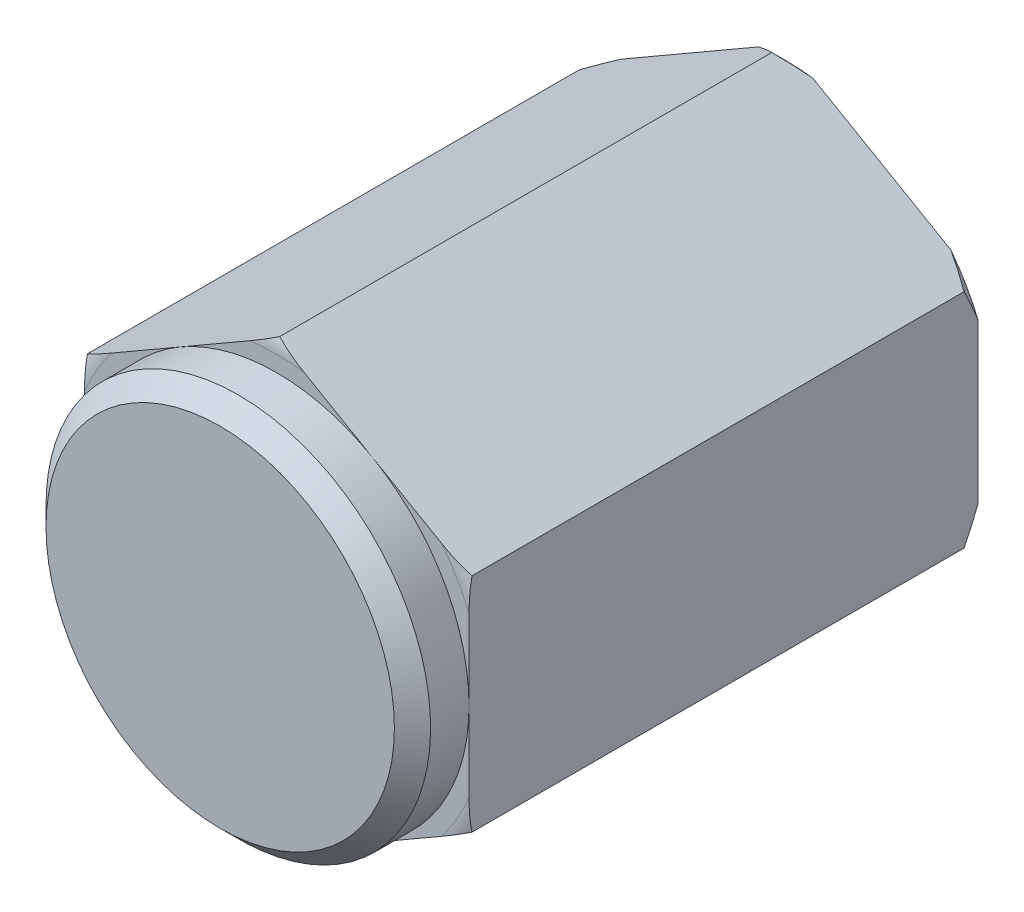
ISO-10303-21;
HEADER;
FILE_DESCRIPTION(('STEP AP214'),'2;1');
FILE_NAME('part.step','',(''),(''),'','','');
FILE_SCHEMA(('AUTOMOTIVE_DESIGN { 1 0 10303 214 1 1 1 1 }'));
ENDSEC;
DATA;
#1=APPLICATION_CONTEXT('core data for automotive mechanical design processes');
#2=APPLICATION_PROTOCOL_DEFINITION('international standard','automotive_design',2000,#1);
#3=PRODUCT_CONTEXT('',#1,'mechanical');
#4=PRODUCT('Part','Part','',(#3));
#5=PRODUCT_RELATED_PRODUCT_CATEGORY('part','',(#4));
#6=PRODUCT_DEFINITION_FORMATION('','',#4);
#7=PRODUCT_DEFINITION_CONTEXT('part definition',#1,'design');
#8=PRODUCT_DEFINITION('design','',#6,#7);
#9=PRODUCT_DEFINITION_SHAPE('','',#8);
#10=(LENGTH_UNIT() NAMED_UNIT(*) SI_UNIT(.MILLI.,.METRE.));
#11=(NAMED_UNIT(*) PLANE_ANGLE_UNIT() SI_UNIT($,.RADIAN.));
#12=(NAMED_UNIT(*) SI_UNIT($,.STERADIAN.) SOLID_ANGLE_UNIT());
#13=UNCERTAINTY_MEASURE_WITH_UNIT(LENGTH_MEASURE(1.E-05),#10,'distance_accuracy_value','');
#14=(GEOMETRIC_REPRESENTATION_CONTEXT(3) GLOBAL_UNCERTAINTY_ASSIGNED_CONTEXT((#13)) GLOBAL_UNIT_ASSIGNED_CONTEXT((#10,
#11,#12)) REPRESENTATION_CONTEXT('',''));
#15=CARTESIAN_POINT('',(0.,0.,0.));
#16=DIRECTION('',(0.,0.,1.));
#17=DIRECTION('',(1.,0.,0.));
#18=AXIS2_PLACEMENT_3D('',#15,#16,#17);
#19=CARTESIAN_POINT('',(8.5,0.,22.5));
#20=DIRECTION('',(0.,0.,1.));
#21=DIRECTION('',(0.,-1.,0.));
#22=AXIS2_PLACEMENT_3D('',#19,#20,#21);
#23=PLANE('',#22);
#24=DIRECTION('',(0.86602540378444,0.5,0.));
#25=VECTOR('',#24,1.);
#26=CARTESIAN_POINT('',(2.12500000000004,11.0418238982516,22.5));
#27=LINE('',#26,#25);
#28=CARTESIAN_POINT('',(-7.29836021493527,5.60124434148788,22.5));
#29=VERTEX_POINT('',#28);
#30=CARTESIAN_POINT('',(-4.25,7.36121593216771,22.5));
#31=VERTEX_POINT('',#30);
#32=EDGE_CURVE('E183',#29,#31,#27,.T.);
#33=ORIENTED_EDGE('',*,*,#32,.F.);
#34=CARTESIAN_POINT('',(0.,0.,22.5));
#35=DIRECTION('',(0.,0.,-1.));
#36=DIRECTION('',(0.,1.,0.));
#37=AXIS2_PLACEMENT_3D('',#34,#35,#36);
#38=CIRCLE('',#37,9.2);
#39=CARTESIAN_POINT('',(-8.5,3.51994318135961,22.5));
#40=VERTEX_POINT('',#39);
#41=EDGE_CURVE('E192',#40,#29,#38,.T.);
#42=ORIENTED_EDGE('',*,*,#41,.F.);
#43=DIRECTION('',(0.,1.,0.));
#44=VECTOR('',#43,1.);
#45=CARTESIAN_POINT('',(-8.5,0.,22.5));
#46=LINE('',#45,#44);
#47=CARTESIAN_POINT('',(-8.5,0.,22.5));
#48=VERTEX_POINT('',#47);
#49=EDGE_CURVE('E377',#48,#40,#46,.T.);
#50=ORIENTED_EDGE('',*,*,#49,.F.);
#51=CARTESIAN_POINT('',(0.,0.,22.5));
#52=DIRECTION('',(0.,0.,-1.));
#53=DIRECTION('',(0.,1.,0.));
#54=AXIS2_PLACEMENT_3D('',#51,#52,#53);
#55=CIRCLE('',#54,8.5);
#56=EDGE_CURVE('E403',#48,#31,#55,.T.);
#57=ORIENTED_EDGE('',*,*,#56,.T.);
#58=EDGE_LOOP('',(#33,#42,#50,#57));
#59=FACE_BOUND('',#58,.T.);
#60=ADVANCED_FACE('F14',(#59),#23,.T.);
#61=CARTESIAN_POINT('',(-8.5,-3.51994318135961,22.5));
#62=VERTEX_POINT('',#61);
#63=EDGE_CURVE('E379',#62,#48,#46,.T.);
#64=ORIENTED_EDGE('',*,*,#63,.F.);
#65=CARTESIAN_POINT('',(-7.29836021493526,-5.60124434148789,22.5));
#66=VERTEX_POINT('',#65);
#67=EDGE_CURVE('E355',#66,#62,#38,.T.);
#68=ORIENTED_EDGE('',*,*,#67,.F.);
#69=DIRECTION('',(-0.86602540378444,0.5,0.));
#70=VECTOR('',#69,1.);
#71=CARTESIAN_POINT('',(2.12500000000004,-11.0418238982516,22.5));
#72=LINE('',#71,#70);
#73=CARTESIAN_POINT('',(-4.25,-7.36121593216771,22.5));
#74=VERTEX_POINT('',#73);
#75=EDGE_CURVE('E230',#74,#66,#72,.T.);
#76=ORIENTED_EDGE('',*,*,#75,.F.);
#77=EDGE_CURVE('E394',#74,#48,#55,.T.);
#78=ORIENTED_EDGE('',*,*,#77,.T.);
#79=EDGE_LOOP('',(#64,#68,#76,#78));
#80=FACE_BOUND('',#79,.T.);
#81=ADVANCED_FACE('F391',(#80),#23,.T.);
#82=CARTESIAN_POINT('',(-1.20163978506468,-9.12118752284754,22.5));
#83=VERTEX_POINT('',#82);
#84=EDGE_CURVE('E219',#83,#74,#72,.T.);
#85=ORIENTED_EDGE('',*,*,#84,.F.);
#86=CARTESIAN_POINT('',(1.20163978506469,-9.12118752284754,22.5));
#87=VERTEX_POINT('',#86);
#88=EDGE_CURVE('E351',#87,#83,#38,.T.);
#89=ORIENTED_EDGE('',*,*,#88,.F.);
#90=DIRECTION('',(-0.86602540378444,-0.5,0.));
#91=VECTOR('',#90,1.);
#92=CARTESIAN_POINT('',(10.625,-3.68060796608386,22.5));
#93=LINE('',#92,#91);
#94=CARTESIAN_POINT('',(4.25,-7.36121593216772,22.5));
#95=VERTEX_POINT('',#94);
#96=EDGE_CURVE('E323',#95,#87,#93,.T.);
#97=ORIENTED_EDGE('',*,*,#96,.F.);
#98=EDGE_CURVE('E449',#95,#74,#55,.T.);
#99=ORIENTED_EDGE('',*,*,#98,.T.);
#100=EDGE_LOOP('',(#85,#89,#97,#99));
#101=FACE_BOUND('',#100,.T.);
#102=ADVANCED_FACE('F478',(#101),#23,.T.);
#103=CARTESIAN_POINT('',(7.29836021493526,-5.60124434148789,22.5));
#104=VERTEX_POINT('',#103);
#105=EDGE_CURVE('E324',#104,#95,#93,.T.);
#106=ORIENTED_EDGE('',*,*,#105,.F.);
#107=CARTESIAN_POINT('',(8.5,-3.51994318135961,22.5));
#108=VERTEX_POINT('',#107);
#109=EDGE_CURVE('E346',#108,#104,#38,.T.);
#110=ORIENTED_EDGE('',*,*,#109,.F.);
#111=DIRECTION('',(0.,-1.,0.));
#112=VECTOR('',#111,1.);
#113=CARTESIAN_POINT('',(8.5,0.,22.5));
#114=LINE('',#113,#112);
#115=CARTESIAN_POINT('',(8.5,0.,22.5));
#116=VERTEX_POINT('',#115);
#117=EDGE_CURVE('E442',#116,#108,#114,.T.);
#118=ORIENTED_EDGE('',*,*,#117,.F.);
#119=EDGE_CURVE('E348',#116,#95,#55,.T.);
#120=ORIENTED_EDGE('',*,*,#119,.T.);
#121=EDGE_LOOP('',(#106,#110,#118,#120));
#122=FACE_BOUND('',#121,.T.);
#123=ADVANCED_FACE('F344',(#122),#23,.T.);
#124=CARTESIAN_POINT('',(8.5,3.51994318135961,22.5));
#125=VERTEX_POINT('',#124);
#126=EDGE_CURVE('E443',#125,#116,#114,.T.);
#127=ORIENTED_EDGE('',*,*,#126,.F.);
#128=CARTESIAN_POINT('',(7.29836021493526,5.60124434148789,22.5));
#129=VERTEX_POINT('',#128);
#130=EDGE_CURVE('E193',#129,#125,#38,.T.);
#131=ORIENTED_EDGE('',*,*,#130,.F.);
#132=DIRECTION('',(0.86602540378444,-0.5,0.));
#133=VECTOR('',#132,1.);
#134=CARTESIAN_POINT('',(10.625,3.68060796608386,22.5));
#135=LINE('',#134,#133);
#136=CARTESIAN_POINT('',(4.25,7.36121593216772,22.5));
#137=VERTEX_POINT('',#136);
#138=EDGE_CURVE('E29',#137,#129,#135,.T.);
#139=ORIENTED_EDGE('',*,*,#138,.F.);
#140=EDGE_CURVE('E357',#137,#116,#55,.T.);
#141=ORIENTED_EDGE('',*,*,#140,.T.);
#142=EDGE_LOOP('',(#127,#131,#139,#141));
#143=FACE_BOUND('',#142,.T.);
#144=ADVANCED_FACE('F451',(#143),#23,.T.);
#145=CARTESIAN_POINT('',(0.,0.,21.0000000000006));
#146=DIRECTION('',(0.,0.,-1.));
#147=DIRECTION('',(0.,1.,0.));
#148=AXIS2_PLACEMENT_3D('',#145,#146,#147);
#149=TOROIDAL_SURFACE('',#148,9.20000000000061,1.49999999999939);
#150=CARTESIAN_POINT('',(-8.50019999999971,4.90736181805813,22.3680967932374));
#151=CARTESIAN_POINT('',(-8.42243016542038,4.95226225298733,22.3882564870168));
#152=CARTESIAN_POINT('',(-8.34414521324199,4.99746009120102,22.4055341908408));
#153=CARTESIAN_POINT('',(-8.18693798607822,5.08822372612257,22.4350729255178));
#154=CARTESIAN_POINT('',(-8.10801638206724,5.13378913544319,22.4473386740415));
#155=CARTESIAN_POINT('',(-7.95029515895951,5.22484952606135,22.4675699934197));
#156=CARTESIAN_POINT('',(-7.87149808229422,5.27034303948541,22.4755630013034));
#157=CARTESIAN_POINT('',(-7.71367937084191,5.36145971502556,22.4879940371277));
#158=CARTESIAN_POINT('',(-7.63465768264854,5.40708290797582,22.4924311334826));
#159=CARTESIAN_POINT('',(-7.3976432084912,5.5439232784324,22.5012598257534));
#160=CARTESIAN_POINT('',(-7.23952867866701,5.63521074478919,22.5011882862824));
#161=CARTESIAN_POINT('',(-6.92320610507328,5.81783966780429,22.4930497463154));
#162=CARTESIAN_POINT('',(-6.76499849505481,5.9091808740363,22.4849669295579));
#163=CARTESIAN_POINT('',(-6.46907097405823,6.0800347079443,22.4655374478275));
#164=CARTESIAN_POINT('',(-6.33132180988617,6.15956422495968,22.4547412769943));
#165=CARTESIAN_POINT('',(-6.05590953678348,6.31857357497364,22.4317511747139));
#166=CARTESIAN_POINT('',(-5.91824643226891,6.39805340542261,22.4195571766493));
#167=CARTESIAN_POINT('',(-5.64291116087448,6.55701829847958,22.3957321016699));
#168=CARTESIAN_POINT('',(-5.50523900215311,6.63650335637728,22.3841009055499));
#169=CARTESIAN_POINT('',(-5.22976250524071,6.79554978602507,22.3631584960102));
#170=CARTESIAN_POINT('',(-5.0919581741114,6.87511115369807,22.3538471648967));
#171=CARTESIAN_POINT('',(-4.81616511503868,7.03434035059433,22.3389591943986));
#172=CARTESIAN_POINT('',(-4.67817635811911,7.11400819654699,22.3333832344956));
#173=CARTESIAN_POINT('',(-4.40211633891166,7.27339152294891,22.3268398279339));
#174=CARTESIAN_POINT('',(-4.26404507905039,7.35310700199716,22.3258722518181));
#175=CARTESIAN_POINT('',(-3.98785640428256,7.51256460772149,22.3286997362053));
#176=CARTESIAN_POINT('',(-3.84973901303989,7.59230672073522,22.3324977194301));
#177=CARTESIAN_POINT('',(-3.57363628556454,7.7517147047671,22.3442625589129));
#178=CARTESIAN_POINT('',(-3.43565095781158,7.83138057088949,22.3522296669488));
#179=CARTESIAN_POINT('',(-3.1606880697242,7.99013046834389,22.3710481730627));
#180=CARTESIAN_POINT('',(-3.02370953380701,8.06921506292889,22.3818815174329));
#181=CARTESIAN_POINT('',(-2.74984480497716,8.22733093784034,22.4048362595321));
#182=CARTESIAN_POINT('',(-2.61295860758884,8.30636222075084,22.4169575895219));
#183=CARTESIAN_POINT('',(-2.33939693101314,8.46430312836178,22.44061012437));
#184=CARTESIAN_POINT('',(-2.20272152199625,8.54321271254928,22.4521423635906));
#185=CARTESIAN_POINT('',(-1.9291803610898,8.70114177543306,22.4726481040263));
#186=CARTESIAN_POINT('',(-1.79231456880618,8.78016127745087,22.4816209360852));
#187=CARTESIAN_POINT('',(-1.51748246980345,8.93883566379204,22.4949086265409));
#188=CARTESIAN_POINT('',(-1.37951491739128,9.01849126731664,22.4991919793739));
#189=CARTESIAN_POINT('',(-1.10362233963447,9.17777792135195,22.5006028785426));
#190=CARTESIAN_POINT('',(-0.965697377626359,9.2574089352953,22.4977364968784));
#191=CARTESIAN_POINT('',(-0.758517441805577,9.37702432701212,22.48598520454));
#192=CARTESIAN_POINT('',(-0.689105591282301,9.41709927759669,22.4807869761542));
#193=CARTESIAN_POINT('',(-0.550501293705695,9.49712250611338,22.4674663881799));
#194=CARTESIAN_POINT('',(-0.481308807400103,9.53707080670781,22.4593445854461));
#195=CARTESIAN_POINT('',(-0.343063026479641,9.61688704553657,22.4397060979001));
#196=CARTESIAN_POINT('',(-0.274010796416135,9.65675436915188,22.4281791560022));
#197=CARTESIAN_POINT('',(-0.136437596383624,9.73618229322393,22.4012082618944));
#198=CARTESIAN_POINT('',(-0.0679170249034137,9.77574266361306,22.3857616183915));
#199=CARTESIAN_POINT('',(0.000200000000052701,9.81507004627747,22.3680967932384));
#200=B_SPLINE_CURVE_WITH_KNOTS('',3,(#150,#151,#152,#153,#154,#155,#156,#157,#158,#159,#160,
#161,#162,#163,#164,#165,#166,#167,#168,#169,#170,#171,#172,#173,#174,#175,#176,#177,#178,#179,
#180,#181,#182,#183,#184,#185,#186,#187,#188,#189,#190,#191,#192,#193,#194,#195,#196,#197,#198,
#199),.UNSPECIFIED.,.F.,.F.,(4,2,2,2,2,2,2,2,2,2,2,2,2,2,2,2,2,2,2,2,2,2,2,2,4),(0.,
0.275987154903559,0.551713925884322,0.825648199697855,1.09965421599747,1.64706775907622,
2.1955641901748,2.6738229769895,3.15210456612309,3.63028440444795,4.108439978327,
4.58668250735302,5.06491160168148,5.54343413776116,6.02198557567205,6.49759167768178,
6.97317277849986,7.44788789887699,7.92272701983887,8.40073706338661,8.87834128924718,
9.11925238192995,9.3601176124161,9.60171591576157,9.84348055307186),.UNSPECIFIED.);
#201=CARTESIAN_POINT('',(-8.5,4.9074772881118,22.3681487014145));
#202=VERTEX_POINT('',#201);
#203=EDGE_CURVE('E179',#202,#29,#200,.T.);
#204=ORIENTED_EDGE('',*,*,#203,.F.);
#205=CARTESIAN_POINT('',(-8.5,0.,22.3266499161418));
#206=CARTESIAN_POINT('',(-8.5,0.125047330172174,22.3266437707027));
#207=CARTESIAN_POINT('',(-8.5,0.250092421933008,22.3281163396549));
#208=CARTESIAN_POINT('',(-8.5,0.500119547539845,22.3338478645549));
#209=CARTESIAN_POINT('',(-8.5,0.625101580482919,22.3381068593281));
#210=CARTESIAN_POINT('',(-8.5,0.875005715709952,22.3490101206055));
#211=CARTESIAN_POINT('',(-8.5,0.999927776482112,22.355655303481));
#212=CARTESIAN_POINT('',(-8.5,1.24966826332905,22.3706958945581));
#213=CARTESIAN_POINT('',(-8.5,1.37448668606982,22.3790913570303));
#214=CARTESIAN_POINT('',(-8.5,1.74936920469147,22.4057855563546));
#215=CARTESIAN_POINT('',(-8.5,1.99931804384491,22.4255620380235));
#216=CARTESIAN_POINT('',(-8.5,2.49942057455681,22.4616637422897));
#217=CARTESIAN_POINT('',(-8.5,2.74957414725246,22.4779903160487));
#218=CARTESIAN_POINT('',(-8.5,3.125574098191,22.4936320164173));
#219=CARTESIAN_POINT('',(-8.5,3.25121665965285,22.4973702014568));
#220=CARTESIAN_POINT('',(-8.5,3.50255169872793,22.5007010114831));
#221=CARTESIAN_POINT('',(-8.5,3.62824416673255,22.5002942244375));
#222=CARTESIAN_POINT('',(-8.5,3.87949943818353,22.4940558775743));
#223=CARTESIAN_POINT('',(-8.5,4.00506225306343,22.4882248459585));
#224=CARTESIAN_POINT('',(-8.5,4.25567676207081,22.4696816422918));
#225=CARTESIAN_POINT('',(-8.5,4.38072860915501,22.4569717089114));
#226=CARTESIAN_POINT('',(-8.5,4.59320883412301,22.4279371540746));
#227=CARTESIAN_POINT('',(-8.5,4.68092863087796,22.4137617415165));
#228=CARTESIAN_POINT('',(-8.5,4.85540226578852,22.3803995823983));
#229=CARTESIAN_POINT('',(-8.5,4.94215637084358,22.3612142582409));
#230=CARTESIAN_POINT('',(-8.5,5.11404821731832,22.3170447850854));
#231=CARTESIAN_POINT('',(-8.5,5.19918836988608,22.2920701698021));
#232=CARTESIAN_POINT('',(-8.5,5.36715872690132,22.2353680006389));
#233=CARTESIAN_POINT('',(-8.5,5.44999046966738,22.2036450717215));
#234=CARTESIAN_POINT('',(-8.5,5.61941349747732,22.1291884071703));
#235=CARTESIAN_POINT('',(-8.5,5.7056926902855,22.0857306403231));
#236=CARTESIAN_POINT('',(-8.5,5.87192631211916,21.9878941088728));
#237=CARTESIAN_POINT('',(-8.5,5.95188525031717,21.9335232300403));
#238=CARTESIAN_POINT('',(-8.5,6.08581680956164,21.8252682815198));
#239=CARTESIAN_POINT('',(-8.5,6.14169180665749,21.7737613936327));
#240=CARTESIAN_POINT('',(-8.5,6.24464781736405,21.6625582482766));
#241=CARTESIAN_POINT('',(-8.5,6.2917436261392,21.6028760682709));
#242=CARTESIAN_POINT('',(-8.5,6.36390910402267,21.4909658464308));
#243=CARTESIAN_POINT('',(-8.5,6.39155175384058,21.4404060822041));
#244=CARTESIAN_POINT('',(-8.5,6.43819940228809,21.3354209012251));
#245=CARTESIAN_POINT('',(-8.5,6.45721080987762,21.2809983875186));
#246=CARTESIAN_POINT('',(-8.5,6.48524460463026,21.1691993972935));
#247=CARTESIAN_POINT('',(-8.5,6.49419819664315,21.1118053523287));
#248=CARTESIAN_POINT('',(-8.5,6.50105152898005,20.9963619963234));
#249=CARTESIAN_POINT('',(-8.5,6.49895516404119,20.9383129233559));
#250=CARTESIAN_POINT('',(-8.5,6.4847137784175,20.8296430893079));
#251=CARTESIAN_POINT('',(-8.5,6.47363571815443,20.778877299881));
#252=CARTESIAN_POINT('',(-8.5,6.44358285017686,20.6797604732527));
#253=CARTESIAN_POINT('',(-8.5,6.42460542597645,20.6314102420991));
#254=CARTESIAN_POINT('',(-8.5,6.37286476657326,20.5233802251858));
#255=CARTESIAN_POINT('',(-8.5,6.3376470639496,20.4648783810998));
#256=CARTESIAN_POINT('',(-8.5,6.25819781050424,20.3543704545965));
#257=CARTESIAN_POINT('',(-8.5,6.21394958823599,20.3023766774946));
#258=CARTESIAN_POINT('',(-8.5,6.09738498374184,20.1830439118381));
#259=CARTESIAN_POINT('',(-8.5,6.02139388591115,20.119316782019));
#260=CARTESIAN_POINT('',(-8.5,5.86054997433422,20.004336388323));
#261=CARTESIAN_POINT('',(-8.5,5.77567843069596,19.9531102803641));
#262=CARTESIAN_POINT('',(-8.5,5.61377586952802,19.8684424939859));
#263=CARTESIAN_POINT('',(-8.5,5.53752226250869,19.833480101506));
#264=CARTESIAN_POINT('',(-8.5,5.38224383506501,19.7702643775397));
#265=CARTESIAN_POINT('',(-8.5,5.30321682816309,19.7420164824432));
#266=CARTESIAN_POINT('',(-8.5,5.14327407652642,19.6913419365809));
#267=CARTESIAN_POINT('',(-8.5,5.06235685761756,19.6689200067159));
#268=CARTESIAN_POINT('',(-8.5,4.89935774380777,19.6291605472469));
#269=CARTESIAN_POINT('',(-8.5,4.81727661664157,19.6118198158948));
#270=CARTESIAN_POINT('',(-8.5,4.57529845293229,19.5673574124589));
#271=CARTESIAN_POINT('',(-8.5,4.41430000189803,19.5462200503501));
#272=CARTESIAN_POINT('',(-8.5,4.09111681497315,19.5162439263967));
#273=CARTESIAN_POINT('',(-8.5,3.92893094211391,19.5074191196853));
#274=CARTESIAN_POINT('',(-8.5,3.60366363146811,19.4988655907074));
#275=CARTESIAN_POINT('',(-8.5,3.44058134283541,19.4991761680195));
#276=CARTESIAN_POINT('',(-8.5,3.1146561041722,19.5062241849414));
#277=CARTESIAN_POINT('',(-8.5,2.95181308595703,19.5129591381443));
#278=CARTESIAN_POINT('',(-8.5,2.625127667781,19.5304671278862));
#279=CARTESIAN_POINT('',(-8.5,2.46128702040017,19.541270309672));
#280=CARTESIAN_POINT('',(-8.5,2.13372641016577,19.5645990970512));
#281=CARTESIAN_POINT('',(-8.5,1.97000645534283,19.5771248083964));
#282=CARTESIAN_POINT('',(-8.5,1.64297146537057,19.6017111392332));
#283=CARTESIAN_POINT('',(-8.5,1.47965652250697,19.6137729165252));
#284=CARTESIAN_POINT('',(-8.5,1.15287121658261,19.6355388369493));
#285=CARTESIAN_POINT('',(-8.5,0.989400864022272,19.6452431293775));
#286=CARTESIAN_POINT('',(-8.5,0.665741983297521,19.6605758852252));
#287=CARTESIAN_POINT('',(-8.5,0.505557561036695,19.6662866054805));
#288=CARTESIAN_POINT('',(-8.5,0.185088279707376,19.673061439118));
#289=CARTESIAN_POINT('',(-8.5,0.0248034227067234,19.674125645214));
#290=CARTESIAN_POINT('',(-8.5,-0.295873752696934,19.6714354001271));
#291=CARTESIAN_POINT('',(-8.5,-0.456266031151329,19.6676764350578));
#292=CARTESIAN_POINT('',(-8.5,-0.776892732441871,19.6559317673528));
#293=CARTESIAN_POINT('',(-8.5,-0.93712714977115,19.6479459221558));
#294=CARTESIAN_POINT('',(-8.5,-1.25758599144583,19.6289802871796));
#295=CARTESIAN_POINT('',(-8.5,-1.41781021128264,19.6179972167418));
#296=CARTESIAN_POINT('',(-8.5,-1.73816473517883,19.594722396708));
#297=CARTESIAN_POINT('',(-8.5,-1.89829503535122,19.5824305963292));
#298=CARTESIAN_POINT('',(-8.5,-2.21852763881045,19.5584782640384));
#299=CARTESIAN_POINT('',(-8.5,-2.37862991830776,19.5468174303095));
#300=CARTESIAN_POINT('',(-8.5,-2.69900275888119,19.5262086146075));
#301=CARTESIAN_POINT('',(-8.5,-2.85927329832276,19.5172603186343));
#302=CARTESIAN_POINT('',(-8.5,-3.18088277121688,19.5042779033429));
#303=CARTESIAN_POINT('',(-8.5,-3.34222288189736,19.5002699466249));
#304=CARTESIAN_POINT('',(-8.5,-3.66505319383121,19.4997558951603));
#305=CARTESIAN_POINT('',(-8.5,-3.82654342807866,19.5032541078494));
#306=CARTESIAN_POINT('',(-8.5,-4.14856635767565,19.5206182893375));
#307=CARTESIAN_POINT('',(-8.5,-4.30910046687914,19.5344554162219));
#308=CARTESIAN_POINT('',(-8.5,-4.62835196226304,19.5759002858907));
#309=CARTESIAN_POINT('',(-8.5,-4.7870713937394,19.6034905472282));
#310=CARTESIAN_POINT('',(-8.5,-5.02283306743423,19.6586867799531));
#311=CARTESIAN_POINT('',(-8.5,-5.10145968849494,19.6795407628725));
#312=CARTESIAN_POINT('',(-8.5,-5.25708187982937,19.726593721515));
#313=CARTESIAN_POINT('',(-8.5,-5.33407822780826,19.7527900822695));
#314=CARTESIAN_POINT('',(-8.5,-5.48546792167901,19.8112258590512));
#315=CARTESIAN_POINT('',(-8.5,-5.55986930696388,19.8434441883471));
#316=CARTESIAN_POINT('',(-8.5,-5.70520821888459,19.9148464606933));
#317=CARTESIAN_POINT('',(-8.5,-5.77614936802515,19.9540229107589));
#318=CARTESIAN_POINT('',(-8.5,-5.9086639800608,20.0375400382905));
#319=CARTESIAN_POINT('',(-8.5,-5.97054654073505,20.0813839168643));
#320=CARTESIAN_POINT('',(-8.5,-6.08819372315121,20.1768370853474));
#321=CARTESIAN_POINT('',(-8.5,-6.14395374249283,20.2284521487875));
#322=CARTESIAN_POINT('',(-8.5,-6.24738381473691,20.3406388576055));
#323=CARTESIAN_POINT('',(-8.5,-6.29493941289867,20.4013181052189));
#324=CARTESIAN_POINT('',(-8.5,-6.37737944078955,20.5307461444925));
#325=CARTESIAN_POINT('',(-8.5,-6.41230192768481,20.5994698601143));
#326=CARTESIAN_POINT('',(-8.5,-6.45741080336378,20.7206871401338));
#327=CARTESIAN_POINT('',(-8.5,-6.47191209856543,20.7715837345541));
#328=CARTESIAN_POINT('',(-8.5,-6.49214767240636,20.8750980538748));
#329=CARTESIAN_POINT('',(-8.5,-6.49788756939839,20.9277146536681));
#330=CARTESIAN_POINT('',(-8.5,-6.50015521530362,21.033224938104));
#331=CARTESIAN_POINT('',(-8.5,-6.49666922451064,21.0861189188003));
#332=CARTESIAN_POINT('',(-8.5,-6.48073543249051,21.1905348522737));
#333=CARTESIAN_POINT('',(-8.5,-6.46828463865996,21.2420563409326));
#334=CARTESIAN_POINT('',(-8.5,-6.43547348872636,21.3419388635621));
#335=CARTESIAN_POINT('',(-8.5,-6.41518858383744,21.3903250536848));
#336=CARTESIAN_POINT('',(-8.5,-6.36789906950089,21.4836609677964));
#337=CARTESIAN_POINT('',(-8.5,-6.34089164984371,21.5286092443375));
#338=CARTESIAN_POINT('',(-8.5,-6.26568501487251,21.6373682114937));
#339=CARTESIAN_POINT('',(-8.5,-6.21381646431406,21.6986438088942));
#340=CARTESIAN_POINT('',(-8.5,-6.10102119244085,21.8121928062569));
#341=CARTESIAN_POINT('',(-8.5,-6.04007197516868,21.8644431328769));
#342=CARTESIAN_POINT('',(-8.5,-5.87621595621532,21.9874037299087));
#343=CARTESIAN_POINT('',(-8.5,-5.76886799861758,22.0521552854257));
#344=CARTESIAN_POINT('',(-8.5,-5.54579886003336,22.1648515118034));
#345=CARTESIAN_POINT('',(-8.5,-5.43005994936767,22.2127592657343));
#346=CARTESIAN_POINT('',(-8.5,-5.20255386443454,22.291920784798));
#347=CARTESIAN_POINT('',(-8.5,-5.09111165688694,22.3241335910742));
#348=CARTESIAN_POINT('',(-8.5,-4.86584173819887,22.3789457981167));
#349=CARTESIAN_POINT('',(-8.5,-4.75201192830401,22.4015363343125));
#350=CARTESIAN_POINT('',(-8.5,-4.52291113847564,22.4388385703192));
#351=CARTESIAN_POINT('',(-8.5,-4.40763805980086,22.4535369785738));
#352=CARTESIAN_POINT('',(-8.5,-4.17651270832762,22.4764460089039));
#353=CARTESIAN_POINT('',(-8.5,-4.06066063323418,22.4846587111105));
#354=CARTESIAN_POINT('',(-8.5,-3.8108358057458,22.4967080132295));
#355=CARTESIAN_POINT('',(-8.5,-3.67682360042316,22.4996745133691));
#356=CARTESIAN_POINT('',(-8.5,-3.40878977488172,22.5002741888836));
#357=CARTESIAN_POINT('',(-8.5,-3.27476815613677,22.4979065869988));
#358=CARTESIAN_POINT('',(-8.5,-2.87309197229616,22.485029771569));
#359=CARTESIAN_POINT('',(-8.5,-2.6056492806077,22.4687510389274));
#360=CARTESIAN_POINT('',(-8.5,-2.14352751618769,22.4362561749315));
#361=CARTESIAN_POINT('',(-8.5,-1.94874188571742,22.421215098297));
#362=CARTESIAN_POINT('',(-8.5,-1.55907278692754,22.3920591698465));
#363=CARTESIAN_POINT('',(-8.5,-1.36418931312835,22.3779443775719));
#364=CARTESIAN_POINT('',(-8.5,-0.974519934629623,22.3538473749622));
#365=CARTESIAN_POINT('',(-8.5,-0.779734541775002,22.3438574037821));
#366=CARTESIAN_POINT('',(-8.5,-0.389964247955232,22.330264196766));
#367=CARTESIAN_POINT('',(-8.5,-0.194979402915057,22.3266594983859));
#368=CARTESIAN_POINT('',(-8.5,0.,22.3266499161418));
#369=B_SPLINE_CURVE_WITH_KNOTS('',3,(#205,#206,#207,#208,#209,#210,#211,#212,#213,#214,#215,
#216,#217,#218,#219,#220,#221,#222,#223,#224,#225,#226,#227,#228,#229,#230,#231,#232,#233,#234,
#235,#236,#237,#238,#239,#240,#241,#242,#243,#244,#245,#246,#247,#248,#249,#250,#251,#252,#253,
#254,#255,#256,#257,#258,#259,#260,#261,#262,#263,#264,#265,#266,#267,#268,#269,#270,#271,#272,
#273,#274,#275,#276,#277,#278,#279,#280,#281,#282,#283,#284,#285,#286,#287,#288,#289,#290,#291,
#292,#293,#294,#295,#296,#297,#298,#299,#300,#301,#302,#303,#304,#305,#306,#307,#308,#309,#310,
#311,#312,#313,#314,#315,#316,#317,#318,#319,#320,#321,#322,#323,#324,#325,#326,#327,#328,#329,
#330,#331,#332,#333,#334,#335,#336,#337,#338,#339,#340,#341,#342,#343,#344,#345,#346,#347,#348,
#349,#350,#351,#352,#353,#354,#355,#356,#357,#358,#359,#360,#361,#362,#363,#364,#365,#366,#367,
#368),.UNSPECIFIED.,.T.,.F.,(4,2,2,2,2,2,2,2,2,2,2,2,2,2,2,2,2,2,2,2,2,2,2,2,2,2,2,2,2,2,2,2,2,
2,2,2,2,2,2,2,2,2,2,2,2,2,2,2,2,2,2,2,2,2,2,2,2,2,2,2,2,2,2,2,2,2,2,2,2,2,2,2,2,2,2,2,2,2,2,2,2,
4),(0.,0.375130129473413,0.750265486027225,1.12554506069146,1.50083627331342,2.2530483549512,
3.00496528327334,3.38200818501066,3.7589976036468,4.13595031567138,4.51278042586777,
4.77923439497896,5.04561279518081,5.31155560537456,5.577316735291,5.86650123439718,
6.15547751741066,6.38272217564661,6.60958033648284,6.78178352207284,6.95385863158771,
7.12710369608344,7.30028770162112,7.45547335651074,7.61071045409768,7.81443221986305,
8.01853353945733,8.31440554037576,8.61091465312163,8.86221768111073,9.11372348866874,
9.36543246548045,9.61698249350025,10.1033958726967,10.5903601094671,11.0794195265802,
11.5682897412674,12.0608560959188,12.5534527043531,13.0447275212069,13.5359712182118,
14.0167722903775,14.4975637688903,14.9788055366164,15.4600635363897,15.9418504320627,
16.4236560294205,16.9052290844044,17.3867463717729,17.8708028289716,18.3551371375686,
18.8381253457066,19.3205011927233,19.5643851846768,19.8081500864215,20.0510768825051,
20.2937436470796,20.5207412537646,20.747908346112,20.9780253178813,21.207443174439,
21.3655335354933,21.5235224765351,21.681746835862,21.8400240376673,21.9968134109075,
22.1536684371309,22.393142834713,22.633220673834,23.0072046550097,23.3820032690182,
23.7294958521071,24.0773078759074,24.4257038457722,24.7739880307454,25.1759789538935,
25.5780284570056,26.3815979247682,26.9677219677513,27.5538836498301,28.1389373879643,
28.7238571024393),.UNSPECIFIED.);
#370=EDGE_CURVE('E378',#40,#202,#369,.T.);
#371=ORIENTED_EDGE('',*,*,#370,.F.);
#372=ORIENTED_EDGE('',*,*,#41,.T.);
#373=EDGE_LOOP('',(#204,#371,#372));
#374=FACE_BOUND('',#373,.T.);
#375=ADVANCED_FACE('F276',(#374),#149,.T.);
#376=CARTESIAN_POINT('',(-8.5,-4.9074772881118,22.3681487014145));
#377=VERTEX_POINT('',#376);
#378=EDGE_CURVE('E218',#377,#62,#369,.T.);
#379=ORIENTED_EDGE('',*,*,#378,.F.);
#380=CARTESIAN_POINT('',(0.0002,-9.81507004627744,22.3680967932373));
#381=CARTESIAN_POINT('',(-0.0775698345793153,-9.77016961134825,22.3882564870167));
#382=CARTESIAN_POINT('',(-0.155854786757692,-9.72497177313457,22.4055341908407));
#383=CARTESIAN_POINT('',(-0.313062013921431,-9.63420813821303,22.4350729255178));
#384=CARTESIAN_POINT('',(-0.391983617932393,-9.58864272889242,22.4473386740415));
#385=CARTESIAN_POINT('',(-0.549704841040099,-9.49758233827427,22.4675699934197));
#386=CARTESIAN_POINT('',(-0.628501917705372,-9.45208882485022,22.4755630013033));
#387=CARTESIAN_POINT('',(-0.78632062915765,-9.36097214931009,22.4879940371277));
#388=CARTESIAN_POINT('',(-0.865342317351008,-9.31534895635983,22.4924311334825));
#389=CARTESIAN_POINT('',(-1.10235679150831,-9.17850858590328,22.5012598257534));
#390=CARTESIAN_POINT('',(-1.26047132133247,-9.08722111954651,22.5011882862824));
#391=CARTESIAN_POINT('',(-1.57679389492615,-8.90459219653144,22.4930497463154));
#392=CARTESIAN_POINT('',(-1.73500150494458,-8.81325099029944,22.484966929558));
#393=CARTESIAN_POINT('',(-2.03092902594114,-8.64239715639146,22.4655374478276));
#394=CARTESIAN_POINT('',(-2.16867819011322,-8.56286763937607,22.4547412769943));
#395=CARTESIAN_POINT('',(-2.44409046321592,-8.40385828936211,22.431751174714));
#396=CARTESIAN_POINT('',(-2.5817535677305,-8.32437845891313,22.4195571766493));
#397=CARTESIAN_POINT('',(-2.85708883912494,-8.16541356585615,22.39573210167));
#398=CARTESIAN_POINT('',(-2.99476099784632,-8.08592850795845,22.38410090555));
#399=CARTESIAN_POINT('',(-3.27023749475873,-7.92688207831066,22.3631584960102));
#400=CARTESIAN_POINT('',(-3.40804182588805,-7.84732071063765,22.3538471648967));
#401=CARTESIAN_POINT('',(-3.68383488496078,-7.68809151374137,22.3389591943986));
#402=CARTESIAN_POINT('',(-3.82182364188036,-7.60842366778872,22.3333832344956));
#403=CARTESIAN_POINT('',(-4.09788366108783,-7.44904034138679,22.3268398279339));
#404=CARTESIAN_POINT('',(-4.2359549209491,-7.36932486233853,22.3258722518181));
#405=CARTESIAN_POINT('',(-4.51214359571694,-7.20986725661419,22.3286997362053));
#406=CARTESIAN_POINT('',(-4.65026098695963,-7.13012514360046,22.3324977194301));
#407=CARTESIAN_POINT('',(-4.92636371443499,-6.97071715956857,22.3442625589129));
#408=CARTESIAN_POINT('',(-5.06434904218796,-6.89105129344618,22.3522296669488));
#409=CARTESIAN_POINT('',(-5.33931193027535,-6.73230139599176,22.3710481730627));
#410=CARTESIAN_POINT('',(-5.47629046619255,-6.65321680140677,22.3818815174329));
#411=CARTESIAN_POINT('',(-5.75015519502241,-6.49510092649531,22.404836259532));
#412=CARTESIAN_POINT('',(-5.88704139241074,-6.41606964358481,22.4169575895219));
#413=CARTESIAN_POINT('',(-6.16060306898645,-6.25812873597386,22.4406101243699));
#414=CARTESIAN_POINT('',(-6.29727847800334,-6.17921915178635,22.4521423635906));
#415=CARTESIAN_POINT('',(-6.5708196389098,-6.02129008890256,22.4726481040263));
#416=CARTESIAN_POINT('',(-6.70768543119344,-5.94227058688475,22.4816209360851));
#417=CARTESIAN_POINT('',(-6.98251753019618,-5.78359620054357,22.4949086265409));
#418=CARTESIAN_POINT('',(-7.12048508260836,-5.70394059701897,22.4991919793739));
#419=CARTESIAN_POINT('',(-7.39637766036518,-5.54465394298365,22.5006028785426));
#420=CARTESIAN_POINT('',(-7.5343026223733,-5.46502292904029,22.4977364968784));
#421=CARTESIAN_POINT('',(-7.74148255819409,-5.34540753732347,22.48598520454));
#422=CARTESIAN_POINT('',(-7.81089440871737,-5.3053325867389,22.4807869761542));
#423=CARTESIAN_POINT('',(-7.94949870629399,-5.2253093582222,22.4674663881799));
#424=CARTESIAN_POINT('',(-8.01869119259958,-5.18536105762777,22.4593445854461));
#425=CARTESIAN_POINT('',(-8.15693697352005,-5.105544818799,22.4397060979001));
#426=CARTESIAN_POINT('',(-8.22598920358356,-5.06567749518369,22.4281791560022));
#427=CARTESIAN_POINT('',(-8.36356240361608,-4.98624957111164,22.4012082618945));
#428=CARTESIAN_POINT('',(-8.4320829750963,-4.94668920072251,22.3857616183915));
#429=CARTESIAN_POINT('',(-8.50019999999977,-4.9073618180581,22.3680967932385));
#430=B_SPLINE_CURVE_WITH_KNOTS('',3,(#380,#381,#382,#383,#384,#385,#386,#387,#388,#389,#390,
#391,#392,#393,#394,#395,#396,#397,#398,#399,#400,#401,#402,#403,#404,#405,#406,#407,#408,#409,
#410,#411,#412,#413,#414,#415,#416,#417,#418,#419,#420,#421,#422,#423,#424,#425,#426,#427,#428,
#429),.UNSPECIFIED.,.F.,.F.,(4,2,2,2,2,2,2,2,2,2,2,2,2,2,2,2,2,2,2,2,2,2,2,2,4),(0.,
0.275987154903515,0.551713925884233,0.825648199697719,1.09965421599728,1.64706775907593,
2.19556419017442,2.67382297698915,3.15210456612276,3.63028440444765,4.10843997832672,
4.58668250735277,5.06491160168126,5.54343413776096,6.02198557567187,6.49759167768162,
6.97317277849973,7.44788789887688,7.92272701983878,8.40073706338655,8.87834128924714,
9.11925238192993,9.36011761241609,9.60171591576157,9.84348055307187),.UNSPECIFIED.);
#431=EDGE_CURVE('E221',#66,#377,#430,.T.);
#432=ORIENTED_EDGE('',*,*,#431,.F.);
#433=ORIENTED_EDGE('',*,*,#67,.T.);
#434=EDGE_LOOP('',(#379,#432,#433));
#435=FACE_BOUND('',#434,.T.);
#436=ADVANCED_FACE('F395',(#435),#149,.T.);
#437=CARTESIAN_POINT('',(0.,-9.8149545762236,22.3681487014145));
#438=VERTEX_POINT('',#437);
#439=EDGE_CURVE('E216',#438,#83,#430,.T.);
#440=ORIENTED_EDGE('',*,*,#439,.F.);
#441=CARTESIAN_POINT('',(8.50019999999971,-4.90736181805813,22.3680967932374));
#442=CARTESIAN_POINT('',(8.42243016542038,-4.95226225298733,22.3882564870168));
#443=CARTESIAN_POINT('',(8.34414521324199,-4.99746009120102,22.4055341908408));
#444=CARTESIAN_POINT('',(8.18693798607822,-5.08822372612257,22.4350729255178));
#445=CARTESIAN_POINT('',(8.10801638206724,-5.13378913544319,22.4473386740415));
#446=CARTESIAN_POINT('',(7.95029515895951,-5.22484952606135,22.4675699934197));
#447=CARTESIAN_POINT('',(7.87149808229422,-5.27034303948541,22.4755630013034));
#448=CARTESIAN_POINT('',(7.71367937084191,-5.36145971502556,22.4879940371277));
#449=CARTESIAN_POINT('',(7.63465768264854,-5.40708290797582,22.4924311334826));
#450=CARTESIAN_POINT('',(7.3976432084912,-5.5439232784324,22.5012598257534));
#451=CARTESIAN_POINT('',(7.23952867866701,-5.63521074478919,22.5011882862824));
#452=CARTESIAN_POINT('',(6.92320610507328,-5.81783966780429,22.4930497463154));
#453=CARTESIAN_POINT('',(6.76499849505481,-5.9091808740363,22.4849669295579));
#454=CARTESIAN_POINT('',(6.46907097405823,-6.0800347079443,22.4655374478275));
#455=CARTESIAN_POINT('',(6.33132180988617,-6.15956422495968,22.4547412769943));
#456=CARTESIAN_POINT('',(6.05590953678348,-6.31857357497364,22.4317511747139));
#457=CARTESIAN_POINT('',(5.91824643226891,-6.39805340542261,22.4195571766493));
#458=CARTESIAN_POINT('',(5.64291116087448,-6.55701829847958,22.3957321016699));
#459=CARTESIAN_POINT('',(5.50523900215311,-6.63650335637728,22.3841009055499));
#460=CARTESIAN_POINT('',(5.22976250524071,-6.79554978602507,22.3631584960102));
#461=CARTESIAN_POINT('',(5.0919581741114,-6.87511115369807,22.3538471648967));
#462=CARTESIAN_POINT('',(4.81616511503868,-7.03434035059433,22.3389591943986));
#463=CARTESIAN_POINT('',(4.67817635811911,-7.11400819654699,22.3333832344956));
#464=CARTESIAN_POINT('',(4.40211633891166,-7.27339152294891,22.3268398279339));
#465=CARTESIAN_POINT('',(4.26404507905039,-7.35310700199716,22.3258722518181));
#466=CARTESIAN_POINT('',(3.98785640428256,-7.51256460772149,22.3286997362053));
#467=CARTESIAN_POINT('',(3.84973901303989,-7.59230672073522,22.3324977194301));
#468=CARTESIAN_POINT('',(3.57363628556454,-7.7517147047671,22.3442625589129));
#469=CARTESIAN_POINT('',(3.43565095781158,-7.83138057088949,22.3522296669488));
#470=CARTESIAN_POINT('',(3.1606880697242,-7.99013046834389,22.3710481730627));
#471=CARTESIAN_POINT('',(3.02370953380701,-8.06921506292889,22.3818815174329));
#472=CARTESIAN_POINT('',(2.74984480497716,-8.22733093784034,22.4048362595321));
#473=CARTESIAN_POINT('',(2.61295860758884,-8.30636222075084,22.4169575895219));
#474=CARTESIAN_POINT('',(2.33939693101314,-8.46430312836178,22.44061012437));
#475=CARTESIAN_POINT('',(2.20272152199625,-8.54321271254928,22.4521423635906));
#476=CARTESIAN_POINT('',(1.9291803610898,-8.70114177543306,22.4726481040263));
#477=CARTESIAN_POINT('',(1.79231456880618,-8.78016127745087,22.4816209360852));
#478=CARTESIAN_POINT('',(1.51748246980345,-8.93883566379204,22.4949086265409));
#479=CARTESIAN_POINT('',(1.37951491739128,-9.01849126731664,22.4991919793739));
#480=CARTESIAN_POINT('',(1.10362233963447,-9.17777792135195,22.5006028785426));
#481=CARTESIAN_POINT('',(0.965697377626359,-9.2574089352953,22.4977364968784));
#482=CARTESIAN_POINT('',(0.758517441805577,-9.37702432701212,22.48598520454));
#483=CARTESIAN_POINT('',(0.689105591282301,-9.41709927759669,22.4807869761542));
#484=CARTESIAN_POINT('',(0.550501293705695,-9.49712250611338,22.4674663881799));
#485=CARTESIAN_POINT('',(0.481308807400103,-9.53707080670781,22.4593445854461));
#486=CARTESIAN_POINT('',(0.343063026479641,-9.61688704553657,22.4397060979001));
#487=CARTESIAN_POINT('',(0.274010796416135,-9.65675436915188,22.4281791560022));
#488=CARTESIAN_POINT('',(0.136437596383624,-9.73618229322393,22.4012082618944));
#489=CARTESIAN_POINT('',(0.0679170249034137,-9.77574266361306,22.3857616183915));
#490=CARTESIAN_POINT('',(-0.000200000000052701,-9.81507004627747,22.3680967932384));
#491=B_SPLINE_CURVE_WITH_KNOTS('',3,(#441,#442,#443,#444,#445,#446,#447,#448,#449,#450,#451,
#452,#453,#454,#455,#456,#457,#458,#459,#460,#461,#462,#463,#464,#465,#466,#467,#468,#469,#470,
#471,#472,#473,#474,#475,#476,#477,#478,#479,#480,#481,#482,#483,#484,#485,#486,#487,#488,#489,
#490),.UNSPECIFIED.,.F.,.F.,(4,2,2,2,2,2,2,2,2,2,2,2,2,2,2,2,2,2,2,2,2,2,2,2,4),(0.,
0.275987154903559,0.551713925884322,0.825648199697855,1.09965421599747,1.64706775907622,
2.1955641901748,2.6738229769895,3.15210456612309,3.63028440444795,4.108439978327,
4.58668250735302,5.06491160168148,5.54343413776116,6.02198557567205,6.49759167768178,
6.97317277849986,7.44788789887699,7.92272701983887,8.40073706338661,8.87834128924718,
9.11925238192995,9.3601176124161,9.60171591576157,9.84348055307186),.UNSPECIFIED.);
#492=EDGE_CURVE('E300',#87,#438,#491,.T.);
#493=ORIENTED_EDGE('',*,*,#492,.F.);
#494=ORIENTED_EDGE('',*,*,#88,.T.);
#495=EDGE_LOOP('',(#440,#493,#494));
#496=FACE_BOUND('',#495,.T.);
#497=ADVANCED_FACE('F482',(#496),#149,.T.);
#498=CARTESIAN_POINT('',(8.5,-4.9074772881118,22.3681487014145));
#499=VERTEX_POINT('',#498);
#500=EDGE_CURVE('E322',#499,#104,#491,.T.);
#501=ORIENTED_EDGE('',*,*,#500,.F.);
#502=CARTESIAN_POINT('',(8.5,0.,22.3266499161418));
#503=CARTESIAN_POINT('',(8.5,-0.125047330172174,22.3266437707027));
#504=CARTESIAN_POINT('',(8.5,-0.250092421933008,22.3281163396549));
#505=CARTESIAN_POINT('',(8.5,-0.500119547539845,22.3338478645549));
#506=CARTESIAN_POINT('',(8.5,-0.625101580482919,22.3381068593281));
#507=CARTESIAN_POINT('',(8.5,-0.875005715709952,22.3490101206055));
#508=CARTESIAN_POINT('',(8.5,-0.999927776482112,22.355655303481));
#509=CARTESIAN_POINT('',(8.5,-1.24966826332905,22.3706958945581));
#510=CARTESIAN_POINT('',(8.5,-1.37448668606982,22.3790913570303));
#511=CARTESIAN_POINT('',(8.5,-1.74936920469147,22.4057855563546));
#512=CARTESIAN_POINT('',(8.5,-1.99931804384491,22.4255620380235));
#513=CARTESIAN_POINT('',(8.5,-2.49942057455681,22.4616637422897));
#514=CARTESIAN_POINT('',(8.5,-2.74957414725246,22.4779903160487));
#515=CARTESIAN_POINT('',(8.5,-3.125574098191,22.4936320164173));
#516=CARTESIAN_POINT('',(8.5,-3.25121665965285,22.4973702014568));
#517=CARTESIAN_POINT('',(8.5,-3.50255169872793,22.5007010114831));
#518=CARTESIAN_POINT('',(8.5,-3.62824416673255,22.5002942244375));
#519=CARTESIAN_POINT('',(8.5,-3.87949943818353,22.4940558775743));
#520=CARTESIAN_POINT('',(8.5,-4.00506225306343,22.4882248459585));
#521=CARTESIAN_POINT('',(8.5,-4.25567676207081,22.4696816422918));
#522=CARTESIAN_POINT('',(8.5,-4.38072860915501,22.4569717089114));
#523=CARTESIAN_POINT('',(8.5,-4.59320883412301,22.4279371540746));
#524=CARTESIAN_POINT('',(8.5,-4.68092863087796,22.4137617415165));
#525=CARTESIAN_POINT('',(8.5,-4.85540226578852,22.3803995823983));
#526=CARTESIAN_POINT('',(8.5,-4.94215637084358,22.3612142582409));
#527=CARTESIAN_POINT('',(8.5,-5.11404821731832,22.3170447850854));
#528=CARTESIAN_POINT('',(8.5,-5.19918836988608,22.2920701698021));
#529=CARTESIAN_POINT('',(8.5,-5.36715872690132,22.2353680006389));
#530=CARTESIAN_POINT('',(8.5,-5.44999046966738,22.2036450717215));
#531=CARTESIAN_POINT('',(8.5,-5.61941349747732,22.1291884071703));
#532=CARTESIAN_POINT('',(8.5,-5.7056926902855,22.0857306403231));
#533=CARTESIAN_POINT('',(8.5,-5.87192631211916,21.9878941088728));
#534=CARTESIAN_POINT('',(8.5,-5.95188525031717,21.9335232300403));
#535=CARTESIAN_POINT('',(8.5,-6.08581680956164,21.8252682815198));
#536=CARTESIAN_POINT('',(8.5,-6.14169180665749,21.7737613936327));
#537=CARTESIAN_POINT('',(8.5,-6.24464781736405,21.6625582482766));
#538=CARTESIAN_POINT('',(8.5,-6.2917436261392,21.6028760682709));
#539=CARTESIAN_POINT('',(8.5,-6.36390910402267,21.4909658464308));
#540=CARTESIAN_POINT('',(8.5,-6.39155175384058,21.4404060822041));
#541=CARTESIAN_POINT('',(8.5,-6.43819940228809,21.3354209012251));
#542=CARTESIAN_POINT('',(8.5,-6.45721080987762,21.2809983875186));
#543=CARTESIAN_POINT('',(8.5,-6.48524460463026,21.1691993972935));
#544=CARTESIAN_POINT('',(8.5,-6.49419819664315,21.1118053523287));
#545=CARTESIAN_POINT('',(8.5,-6.50105152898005,20.9963619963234));
#546=CARTESIAN_POINT('',(8.5,-6.49895516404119,20.9383129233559));
#547=CARTESIAN_POINT('',(8.5,-6.4847137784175,20.8296430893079));
#548=CARTESIAN_POINT('',(8.5,-6.47363571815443,20.778877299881));
#549=CARTESIAN_POINT('',(8.5,-6.44358285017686,20.6797604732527));
#550=CARTESIAN_POINT('',(8.5,-6.42460542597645,20.6314102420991));
#551=CARTESIAN_POINT('',(8.5,-6.37286476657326,20.5233802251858));
#552=CARTESIAN_POINT('',(8.5,-6.3376470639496,20.4648783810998));
#553=CARTESIAN_POINT('',(8.5,-6.25819781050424,20.3543704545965));
#554=CARTESIAN_POINT('',(8.5,-6.21394958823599,20.3023766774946));
#555=CARTESIAN_POINT('',(8.5,-6.09738498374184,20.1830439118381));
#556=CARTESIAN_POINT('',(8.5,-6.02139388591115,20.119316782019));
#557=CARTESIAN_POINT('',(8.5,-5.86054997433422,20.004336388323));
#558=CARTESIAN_POINT('',(8.5,-5.77567843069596,19.9531102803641));
#559=CARTESIAN_POINT('',(8.5,-5.61377586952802,19.8684424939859));
#560=CARTESIAN_POINT('',(8.5,-5.53752226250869,19.833480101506));
#561=CARTESIAN_POINT('',(8.5,-5.38224383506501,19.7702643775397));
#562=CARTESIAN_POINT('',(8.5,-5.30321682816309,19.7420164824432));
#563=CARTESIAN_POINT('',(8.5,-5.14327407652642,19.6913419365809));
#564=CARTESIAN_POINT('',(8.5,-5.06235685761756,19.6689200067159));
#565=CARTESIAN_POINT('',(8.5,-4.89935774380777,19.6291605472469));
#566=CARTESIAN_POINT('',(8.5,-4.81727661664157,19.6118198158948));
#567=CARTESIAN_POINT('',(8.5,-4.57529845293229,19.5673574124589));
#568=CARTESIAN_POINT('',(8.5,-4.41430000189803,19.5462200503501));
#569=CARTESIAN_POINT('',(8.5,-4.09111681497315,19.5162439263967));
#570=CARTESIAN_POINT('',(8.5,-3.92893094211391,19.5074191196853));
#571=CARTESIAN_POINT('',(8.5,-3.60366363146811,19.4988655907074));
#572=CARTESIAN_POINT('',(8.5,-3.44058134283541,19.4991761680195));
#573=CARTESIAN_POINT('',(8.5,-3.1146561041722,19.5062241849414));
#574=CARTESIAN_POINT('',(8.5,-2.95181308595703,19.5129591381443));
#575=CARTESIAN_POINT('',(8.5,-2.625127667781,19.5304671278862));
#576=CARTESIAN_POINT('',(8.5,-2.46128702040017,19.541270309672));
#577=CARTESIAN_POINT('',(8.5,-2.13372641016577,19.5645990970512));
#578=CARTESIAN_POINT('',(8.5,-1.97000645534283,19.5771248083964));
#579=CARTESIAN_POINT('',(8.5,-1.64297146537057,19.6017111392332));
#580=CARTESIAN_POINT('',(8.5,-1.47965652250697,19.6137729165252));
#581=CARTESIAN_POINT('',(8.5,-1.15287121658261,19.6355388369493));
#582=CARTESIAN_POINT('',(8.5,-0.989400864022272,19.6452431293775));
#583=CARTESIAN_POINT('',(8.5,-0.665741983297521,19.6605758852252));
#584=CARTESIAN_POINT('',(8.5,-0.505557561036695,19.6662866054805));
#585=CARTESIAN_POINT('',(8.5,-0.185088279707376,19.673061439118));
#586=CARTESIAN_POINT('',(8.5,-0.0248034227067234,19.674125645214));
#587=CARTESIAN_POINT('',(8.5,0.295873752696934,19.6714354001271));
#588=CARTESIAN_POINT('',(8.5,0.456266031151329,19.6676764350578));
#589=CARTESIAN_POINT('',(8.5,0.776892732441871,19.6559317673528));
#590=CARTESIAN_POINT('',(8.5,0.93712714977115,19.6479459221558));
#591=CARTESIAN_POINT('',(8.5,1.25758599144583,19.6289802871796));
#592=CARTESIAN_POINT('',(8.5,1.41781021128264,19.6179972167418));
#593=CARTESIAN_POINT('',(8.5,1.73816473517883,19.594722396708));
#594=CARTESIAN_POINT('',(8.5,1.89829503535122,19.5824305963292));
#595=CARTESIAN_POINT('',(8.5,2.21852763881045,19.5584782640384));
#596=CARTESIAN_POINT('',(8.5,2.37862991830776,19.5468174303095));
#597=CARTESIAN_POINT('',(8.5,2.69900275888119,19.5262086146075));
#598=CARTESIAN_POINT('',(8.5,2.85927329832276,19.5172603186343));
#599=CARTESIAN_POINT('',(8.5,3.18088277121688,19.5042779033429));
#600=CARTESIAN_POINT('',(8.5,3.34222288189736,19.5002699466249));
#601=CARTESIAN_POINT('',(8.5,3.66505319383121,19.4997558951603));
#602=CARTESIAN_POINT('',(8.5,3.82654342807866,19.5032541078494));
#603=CARTESIAN_POINT('',(8.5,4.14856635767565,19.5206182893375));
#604=CARTESIAN_POINT('',(8.5,4.30910046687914,19.5344554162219));
#605=CARTESIAN_POINT('',(8.5,4.62835196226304,19.5759002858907));
#606=CARTESIAN_POINT('',(8.5,4.7870713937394,19.6034905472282));
#607=CARTESIAN_POINT('',(8.5,5.02283306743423,19.6586867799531));
#608=CARTESIAN_POINT('',(8.5,5.10145968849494,19.6795407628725));
#609=CARTESIAN_POINT('',(8.5,5.25708187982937,19.726593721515));
#610=CARTESIAN_POINT('',(8.5,5.33407822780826,19.7527900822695));
#611=CARTESIAN_POINT('',(8.5,5.48546792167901,19.8112258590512));
#612=CARTESIAN_POINT('',(8.5,5.55986930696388,19.8434441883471));
#613=CARTESIAN_POINT('',(8.5,5.70520821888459,19.9148464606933));
#614=CARTESIAN_POINT('',(8.5,5.77614936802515,19.9540229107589));
#615=CARTESIAN_POINT('',(8.5,5.9086639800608,20.0375400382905));
#616=CARTESIAN_POINT('',(8.5,5.97054654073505,20.0813839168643));
#617=CARTESIAN_POINT('',(8.5,6.08819372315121,20.1768370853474));
#618=CARTESIAN_POINT('',(8.5,6.14395374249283,20.2284521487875));
#619=CARTESIAN_POINT('',(8.5,6.24738381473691,20.3406388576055));
#620=CARTESIAN_POINT('',(8.5,6.29493941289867,20.4013181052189));
#621=CARTESIAN_POINT('',(8.5,6.37737944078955,20.5307461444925));
#622=CARTESIAN_POINT('',(8.5,6.41230192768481,20.5994698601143));
#623=CARTESIAN_POINT('',(8.5,6.45741080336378,20.7206871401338));
#624=CARTESIAN_POINT('',(8.5,6.47191209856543,20.7715837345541));
#625=CARTESIAN_POINT('',(8.5,6.49214767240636,20.8750980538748));
#626=CARTESIAN_POINT('',(8.5,6.49788756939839,20.9277146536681));
#627=CARTESIAN_POINT('',(8.5,6.50015521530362,21.033224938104));
#628=CARTESIAN_POINT('',(8.5,6.49666922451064,21.0861189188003));
#629=CARTESIAN_POINT('',(8.5,6.48073543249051,21.1905348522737));
#630=CARTESIAN_POINT('',(8.5,6.46828463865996,21.2420563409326));
#631=CARTESIAN_POINT('',(8.5,6.43547348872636,21.3419388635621));
#632=CARTESIAN_POINT('',(8.5,6.41518858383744,21.3903250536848));
#633=CARTESIAN_POINT('',(8.5,6.36789906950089,21.4836609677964));
#634=CARTESIAN_POINT('',(8.5,6.34089164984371,21.5286092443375));
#635=CARTESIAN_POINT('',(8.5,6.26568501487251,21.6373682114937));
#636=CARTESIAN_POINT('',(8.5,6.21381646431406,21.6986438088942));
#637=CARTESIAN_POINT('',(8.5,6.10102119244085,21.8121928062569));
#638=CARTESIAN_POINT('',(8.5,6.04007197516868,21.8644431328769));
#639=CARTESIAN_POINT('',(8.5,5.87621595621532,21.9874037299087));
#640=CARTESIAN_POINT('',(8.5,5.76886799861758,22.0521552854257));
#641=CARTESIAN_POINT('',(8.5,5.54579886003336,22.1648515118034));
#642=CARTESIAN_POINT('',(8.5,5.43005994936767,22.2127592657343));
#643=CARTESIAN_POINT('',(8.5,5.20255386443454,22.291920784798));
#644=CARTESIAN_POINT('',(8.5,5.09111165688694,22.3241335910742));
#645=CARTESIAN_POINT('',(8.5,4.86584173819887,22.3789457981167));
#646=CARTESIAN_POINT('',(8.5,4.75201192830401,22.4015363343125));
#647=CARTESIAN_POINT('',(8.5,4.52291113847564,22.4388385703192));
#648=CARTESIAN_POINT('',(8.5,4.40763805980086,22.4535369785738));
#649=CARTESIAN_POINT('',(8.5,4.17651270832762,22.4764460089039));
#650=CARTESIAN_POINT('',(8.5,4.06066063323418,22.4846587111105));
#651=CARTESIAN_POINT('',(8.5,3.8108358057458,22.4967080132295));
#652=CARTESIAN_POINT('',(8.5,3.67682360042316,22.4996745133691));
#653=CARTESIAN_POINT('',(8.5,3.40878977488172,22.5002741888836));
#654=CARTESIAN_POINT('',(8.5,3.27476815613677,22.4979065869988));
#655=CARTESIAN_POINT('',(8.5,2.87309197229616,22.485029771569));
#656=CARTESIAN_POINT('',(8.5,2.6056492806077,22.4687510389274));
#657=CARTESIAN_POINT('',(8.5,2.14352751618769,22.4362561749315));
#658=CARTESIAN_POINT('',(8.5,1.94874188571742,22.421215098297));
#659=CARTESIAN_POINT('',(8.5,1.55907278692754,22.3920591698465));
#660=CARTESIAN_POINT('',(8.5,1.36418931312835,22.3779443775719));
#661=CARTESIAN_POINT('',(8.5,0.974519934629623,22.3538473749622));
#662=CARTESIAN_POINT('',(8.5,0.779734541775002,22.3438574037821));
#663=CARTESIAN_POINT('',(8.5,0.389964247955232,22.330264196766));
#664=CARTESIAN_POINT('',(8.5,0.194979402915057,22.3266594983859));
#665=CARTESIAN_POINT('',(8.5,0.,22.3266499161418));
#666=B_SPLINE_CURVE_WITH_KNOTS('',3,(#502,#503,#504,#505,#506,#507,#508,#509,#510,#511,#512,
#513,#514,#515,#516,#517,#518,#519,#520,#521,#522,#523,#524,#525,#526,#527,#528,#529,#530,#531,
#532,#533,#534,#535,#536,#537,#538,#539,#540,#541,#542,#543,#544,#545,#546,#547,#548,#549,#550,
#551,#552,#553,#554,#555,#556,#557,#558,#559,#560,#561,#562,#563,#564,#565,#566,#567,#568,#569,
#570,#571,#572,#573,#574,#575,#576,#577,#578,#579,#580,#581,#582,#583,#584,#585,#586,#587,#588,
#589,#590,#591,#592,#593,#594,#595,#596,#597,#598,#599,#600,#601,#602,#603,#604,#605,#606,#607,
#608,#609,#610,#611,#612,#613,#614,#615,#616,#617,#618,#619,#620,#621,#622,#623,#624,#625,#626,
#627,#628,#629,#630,#631,#632,#633,#634,#635,#636,#637,#638,#639,#640,#641,#642,#643,#644,#645,
#646,#647,#648,#649,#650,#651,#652,#653,#654,#655,#656,#657,#658,#659,#660,#661,#662,#663,#664,
#665),.UNSPECIFIED.,.T.,.F.,(4,2,2,2,2,2,2,2,2,2,2,2,2,2,2,2,2,2,2,2,2,2,2,2,2,2,2,2,2,2,2,2,2,
2,2,2,2,2,2,2,2,2,2,2,2,2,2,2,2,2,2,2,2,2,2,2,2,2,2,2,2,2,2,2,2,2,2,2,2,2,2,2,2,2,2,2,2,2,2,2,2,
4),(0.,0.375130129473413,0.750265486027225,1.12554506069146,1.50083627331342,2.2530483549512,
3.00496528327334,3.38200818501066,3.7589976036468,4.13595031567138,4.51278042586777,
4.77923439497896,5.04561279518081,5.31155560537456,5.577316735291,5.86650123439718,
6.15547751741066,6.38272217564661,6.60958033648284,6.78178352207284,6.95385863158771,
7.12710369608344,7.30028770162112,7.45547335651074,7.61071045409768,7.81443221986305,
8.01853353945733,8.31440554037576,8.61091465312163,8.86221768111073,9.11372348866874,
9.36543246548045,9.61698249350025,10.1033958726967,10.5903601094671,11.0794195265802,
11.5682897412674,12.0608560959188,12.5534527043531,13.0447275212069,13.5359712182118,
14.0167722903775,14.4975637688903,14.9788055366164,15.4600635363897,15.9418504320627,
16.4236560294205,16.9052290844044,17.3867463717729,17.8708028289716,18.3551371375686,
18.8381253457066,19.3205011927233,19.5643851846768,19.8081500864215,20.0510768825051,
20.2937436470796,20.5207412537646,20.747908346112,20.9780253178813,21.207443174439,
21.3655335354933,21.5235224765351,21.681746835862,21.8400240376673,21.9968134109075,
22.1536684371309,22.393142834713,22.633220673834,23.0072046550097,23.3820032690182,
23.7294958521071,24.0773078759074,24.4257038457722,24.7739880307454,25.1759789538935,
25.5780284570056,26.3815979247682,26.9677219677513,27.5538836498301,28.1389373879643,
28.7238571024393),.UNSPECIFIED.);
#667=EDGE_CURVE('E350',#108,#499,#666,.T.);
#668=ORIENTED_EDGE('',*,*,#667,.F.);
#669=ORIENTED_EDGE('',*,*,#109,.T.);
#670=EDGE_LOOP('',(#501,#668,#669));
#671=FACE_BOUND('',#670,.T.);
#672=ADVANCED_FACE('F349',(#671),#149,.T.);
#673=CARTESIAN_POINT('',(-1.20163978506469,9.12118752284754,22.5));
#674=VERTEX_POINT('',#673);
#675=CARTESIAN_POINT('',(0.,9.8149545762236,22.3681487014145));
#676=VERTEX_POINT('',#675);
#677=EDGE_CURVE('E185',#674,#676,#200,.T.);
#678=ORIENTED_EDGE('',*,*,#677,.F.);
#679=CARTESIAN_POINT('',(1.20163978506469,9.12118752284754,22.5));
#680=VERTEX_POINT('',#679);
#681=EDGE_CURVE('E188',#674,#680,#38,.T.);
#682=ORIENTED_EDGE('',*,*,#681,.T.);
#683=CARTESIAN_POINT('',(-0.0002,9.81507004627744,22.3680967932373));
#684=CARTESIAN_POINT('',(0.0775698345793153,9.77016961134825,22.3882564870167));
#685=CARTESIAN_POINT('',(0.155854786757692,9.72497177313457,22.4055341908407));
#686=CARTESIAN_POINT('',(0.313062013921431,9.63420813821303,22.4350729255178));
#687=CARTESIAN_POINT('',(0.391983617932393,9.58864272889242,22.4473386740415));
#688=CARTESIAN_POINT('',(0.549704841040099,9.49758233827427,22.4675699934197));
#689=CARTESIAN_POINT('',(0.628501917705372,9.45208882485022,22.4755630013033));
#690=CARTESIAN_POINT('',(0.78632062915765,9.36097214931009,22.4879940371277));
#691=CARTESIAN_POINT('',(0.865342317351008,9.31534895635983,22.4924311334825));
#692=CARTESIAN_POINT('',(1.10235679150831,9.17850858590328,22.5012598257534));
#693=CARTESIAN_POINT('',(1.26047132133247,9.08722111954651,22.5011882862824));
#694=CARTESIAN_POINT('',(1.57679389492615,8.90459219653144,22.4930497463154));
#695=CARTESIAN_POINT('',(1.73500150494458,8.81325099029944,22.484966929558));
#696=CARTESIAN_POINT('',(2.03092902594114,8.64239715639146,22.4655374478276));
#697=CARTESIAN_POINT('',(2.16867819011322,8.56286763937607,22.4547412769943));
#698=CARTESIAN_POINT('',(2.44409046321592,8.40385828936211,22.431751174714));
#699=CARTESIAN_POINT('',(2.5817535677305,8.32437845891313,22.4195571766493));
#700=CARTESIAN_POINT('',(2.85708883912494,8.16541356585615,22.39573210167));
#701=CARTESIAN_POINT('',(2.99476099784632,8.08592850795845,22.38410090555));
#702=CARTESIAN_POINT('',(3.27023749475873,7.92688207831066,22.3631584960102));
#703=CARTESIAN_POINT('',(3.40804182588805,7.84732071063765,22.3538471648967));
#704=CARTESIAN_POINT('',(3.68383488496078,7.68809151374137,22.3389591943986));
#705=CARTESIAN_POINT('',(3.82182364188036,7.60842366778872,22.3333832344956));
#706=CARTESIAN_POINT('',(4.09788366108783,7.44904034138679,22.3268398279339));
#707=CARTESIAN_POINT('',(4.2359549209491,7.36932486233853,22.3258722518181));
#708=CARTESIAN_POINT('',(4.51214359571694,7.20986725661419,22.3286997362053));
#709=CARTESIAN_POINT('',(4.65026098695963,7.13012514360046,22.3324977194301));
#710=CARTESIAN_POINT('',(4.92636371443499,6.97071715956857,22.3442625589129));
#711=CARTESIAN_POINT('',(5.06434904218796,6.89105129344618,22.3522296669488));
#712=CARTESIAN_POINT('',(5.33931193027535,6.73230139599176,22.3710481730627));
#713=CARTESIAN_POINT('',(5.47629046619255,6.65321680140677,22.3818815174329));
#714=CARTESIAN_POINT('',(5.75015519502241,6.49510092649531,22.404836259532));
#715=CARTESIAN_POINT('',(5.88704139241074,6.41606964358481,22.4169575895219));
#716=CARTESIAN_POINT('',(6.16060306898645,6.25812873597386,22.4406101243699));
#717=CARTESIAN_POINT('',(6.29727847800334,6.17921915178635,22.4521423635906));
#718=CARTESIAN_POINT('',(6.5708196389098,6.02129008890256,22.4726481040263));
#719=CARTESIAN_POINT('',(6.70768543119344,5.94227058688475,22.4816209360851));
#720=CARTESIAN_POINT('',(6.98251753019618,5.78359620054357,22.4949086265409));
#721=CARTESIAN_POINT('',(7.12048508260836,5.70394059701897,22.4991919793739));
#722=CARTESIAN_POINT('',(7.39637766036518,5.54465394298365,22.5006028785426));
#723=CARTESIAN_POINT('',(7.5343026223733,5.46502292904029,22.4977364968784));
#724=CARTESIAN_POINT('',(7.74148255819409,5.34540753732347,22.48598520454));
#725=CARTESIAN_POINT('',(7.81089440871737,5.3053325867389,22.4807869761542));
#726=CARTESIAN_POINT('',(7.94949870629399,5.2253093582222,22.4674663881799));
#727=CARTESIAN_POINT('',(8.01869119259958,5.18536105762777,22.4593445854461));
#728=CARTESIAN_POINT('',(8.15693697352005,5.105544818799,22.4397060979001));
#729=CARTESIAN_POINT('',(8.22598920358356,5.06567749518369,22.4281791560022));
#730=CARTESIAN_POINT('',(8.36356240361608,4.98624957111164,22.4012082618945));
#731=CARTESIAN_POINT('',(8.4320829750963,4.94668920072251,22.3857616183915));
#732=CARTESIAN_POINT('',(8.50019999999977,4.9073618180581,22.3680967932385));
#733=B_SPLINE_CURVE_WITH_KNOTS('',3,(#683,#684,#685,#686,#687,#688,#689,#690,#691,#692,#693,
#694,#695,#696,#697,#698,#699,#700,#701,#702,#703,#704,#705,#706,#707,#708,#709,#710,#711,#712,
#713,#714,#715,#716,#717,#718,#719,#720,#721,#722,#723,#724,#725,#726,#727,#728,#729,#730,#731,
#732),.UNSPECIFIED.,.F.,.F.,(4,2,2,2,2,2,2,2,2,2,2,2,2,2,2,2,2,2,2,2,2,2,2,2,4),(0.,
0.275987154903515,0.551713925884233,0.825648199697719,1.09965421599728,1.64706775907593,
2.19556419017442,2.67382297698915,3.15210456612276,3.63028440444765,4.10843997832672,
4.58668250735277,5.06491160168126,5.54343413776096,6.02198557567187,6.49759167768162,
6.97317277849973,7.44788789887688,7.92272701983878,8.40073706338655,8.87834128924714,
9.11925238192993,9.36011761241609,9.60171591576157,9.84348055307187),.UNSPECIFIED.);
#734=EDGE_CURVE('E412',#676,#680,#733,.T.);
#735=ORIENTED_EDGE('',*,*,#734,.F.);
#736=EDGE_LOOP('',(#678,#682,#735));
#737=FACE_BOUND('',#736,.T.);
#738=ADVANCED_FACE('F277',(#737),#149,.T.);
#739=CARTESIAN_POINT('',(0.,0.,25.));
#740=DIRECTION('',(0.,0.,1.));
#741=DIRECTION('',(0.,-1.,0.));
#742=AXIS2_PLACEMENT_3D('',#739,#740,#741);
#743=PLANE('',#742);
#744=CARTESIAN_POINT('',(0.,0.,25.));
#745=DIRECTION('',(0.,0.,-1.));
#746=DIRECTION('',(0.,1.,0.));
#747=AXIS2_PLACEMENT_3D('',#744,#745,#746);
#748=CIRCLE('',#747,7.7);
#749=CARTESIAN_POINT('',(0.,7.7,25.));
#750=VERTEX_POINT('',#749);
#751=EDGE_CURVE('E164',#750,#750,#748,.T.);
#752=ORIENTED_EDGE('',*,*,#751,.F.);
#753=EDGE_LOOP('',(#752));
#754=FACE_BOUND('',#753,.T.);
#755=ADVANCED_FACE('F16',(#754),#743,.T.);
#756=CARTESIAN_POINT('',(0.,0.,24.2));
#757=DIRECTION('',(0.,0.,-1.));
#758=DIRECTION('',(0.,1.,0.));
#759=AXIS2_PLACEMENT_3D('',#756,#757,#758);
#760=CONICAL_SURFACE('',#759,8.5,0.785398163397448);
#761=ORIENTED_EDGE('',*,*,#751,.T.);
#762=EDGE_LOOP('',(#761));
#763=FACE_BOUND('',#762,.T.);
#764=CARTESIAN_POINT('',(0.,0.,24.2));
#765=DIRECTION('',(0.,0.,-1.));
#766=DIRECTION('',(0.,1.,0.));
#767=AXIS2_PLACEMENT_3D('',#764,#765,#766);
#768=CIRCLE('',#767,8.5);
#769=CARTESIAN_POINT('',(0.,8.5,24.2));
#770=VERTEX_POINT('',#769);
#771=EDGE_CURVE('E360',#770,#770,#768,.T.);
#772=ORIENTED_EDGE('',*,*,#771,.F.);
#773=EDGE_LOOP('',(#772));
#774=FACE_BOUND('',#773,.T.);
#775=ADVANCED_FACE('F503',(#763,#774),#760,.T.);
#776=CARTESIAN_POINT('',(0.,0.,0.));
#777=DIRECTION('',(0.,0.,-1.));
#778=DIRECTION('',(0.,1.,0.));
#779=AXIS2_PLACEMENT_3D('',#776,#777,#778);
#780=CYLINDRICAL_SURFACE('',#779,8.5);
#781=ORIENTED_EDGE('',*,*,#771,.T.);
#782=EDGE_LOOP('',(#781));
#783=FACE_BOUND('',#782,.T.);
#784=EDGE_CURVE('E353',#31,#137,#55,.T.);
#785=ORIENTED_EDGE('',*,*,#784,.F.);
#786=ORIENTED_EDGE('',*,*,#56,.F.);
#787=ORIENTED_EDGE('',*,*,#77,.F.);
#788=ORIENTED_EDGE('',*,*,#98,.F.);
#789=ORIENTED_EDGE('',*,*,#119,.F.);
#790=ORIENTED_EDGE('',*,*,#140,.F.);
#791=EDGE_LOOP('',(#785,#786,#787,#788,#789,#790));
#792=FACE_BOUND('',#791,.T.);
#793=ADVANCED_FACE('F447',(#783,#792),#780,.T.);
#794=EDGE_CURVE('E270',#31,#674,#27,.T.);
#795=ORIENTED_EDGE('',*,*,#794,.F.);
#796=ORIENTED_EDGE('',*,*,#784,.T.);
#797=EDGE_CURVE('E414',#680,#137,#135,.T.);
#798=ORIENTED_EDGE('',*,*,#797,.F.);
#799=ORIENTED_EDGE('',*,*,#681,.F.);
#800=EDGE_LOOP('',(#795,#796,#798,#799));
#801=FACE_BOUND('',#800,.T.);
#802=ADVANCED_FACE('F274',(#801),#23,.T.);
#803=CARTESIAN_POINT('',(8.5,4.9074772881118,22.3681487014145));
#804=VERTEX_POINT('',#803);
#805=EDGE_CURVE('E291',#804,#125,#666,.T.);
#806=ORIENTED_EDGE('',*,*,#805,.F.);
#807=EDGE_CURVE('E172',#129,#804,#733,.T.);
#808=ORIENTED_EDGE('',*,*,#807,.F.);
#809=ORIENTED_EDGE('',*,*,#130,.T.);
#810=EDGE_LOOP('',(#806,#808,#809));
#811=FACE_BOUND('',#810,.T.);
#812=ADVANCED_FACE('F251',(#811),#149,.T.);
#813=CARTESIAN_POINT('',(0.,9.8149545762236,26.));
#814=DIRECTION('',(0.5,-0.86602540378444,0.));
#815=DIRECTION('',(0.86602540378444,0.5,0.));
#816=AXIS2_PLACEMENT_3D('',#813,#814,#815);
#817=PLANE('',#816);
#818=ORIENTED_EDGE('',*,*,#203,.T.);
#819=ORIENTED_EDGE('',*,*,#32,.T.);
#820=ORIENTED_EDGE('',*,*,#794,.T.);
#821=ORIENTED_EDGE('',*,*,#677,.T.);
#822=DIRECTION('',(0.,0.,-1.));
#823=VECTOR('',#822,1.);
#824=CARTESIAN_POINT('',(0.,9.8149545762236,26.));
#825=LINE('',#824,#823);
#826=CARTESIAN_POINT('',(0.,9.8149545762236,0.6149545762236));
#827=VERTEX_POINT('',#826);
#828=EDGE_CURVE('E376',#676,#827,#825,.T.);
#829=ORIENTED_EDGE('',*,*,#828,.T.);
#830=CARTESIAN_POINT('',(0.000200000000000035,9.81507004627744,0.615070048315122));
#831=CARTESIAN_POINT('',(-0.097883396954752,9.75844157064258,0.55844252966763));
#832=CARTESIAN_POINT('',(-0.196478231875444,9.70151781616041,0.502984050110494));
#833=CARTESIAN_POINT('',(-0.394666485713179,9.58709377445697,0.394683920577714));
#834=CARTESIAN_POINT('',(-0.494259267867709,9.52959385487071,0.341840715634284));
#835=CARTESIAN_POINT('',(-0.694543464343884,9.41395972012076,0.238977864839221));
#836=CARTESIAN_POINT('',(-0.795234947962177,9.35582546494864,0.188958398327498));
#837=CARTESIAN_POINT('',(-0.99779211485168,9.2388790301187,0.0919939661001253));
#838=CARTESIAN_POINT('',(-1.0996584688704,9.18006646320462,0.0450508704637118));
#839=CARTESIAN_POINT('',(-1.20209251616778,9.1209261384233,-0.000200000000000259));
#840=B_SPLINE_CURVE_WITH_KNOTS('',3,(#830,#831,#832,#833,#834,#835,#836,#837,#838,#839),
.UNSPECIFIED.,.F.,.F.,(4,2,2,2,4),(0.,0.37987510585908,0.759521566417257,1.13919211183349,
1.51909135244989),.UNSPECIFIED.);
#841=CARTESIAN_POINT('',(-1.20163978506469,9.12118752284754,0.));
#842=VERTEX_POINT('',#841);
#843=EDGE_CURVE('E171',#827,#842,#840,.T.);
#844=ORIENTED_EDGE('',*,*,#843,.T.);
#845=DIRECTION('',(-0.86602540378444,-0.5,0.));
#846=VECTOR('',#845,1.);
#847=CARTESIAN_POINT('',(2.65000000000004,11.3449327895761,0.));
#848=LINE('',#847,#846);
#849=CARTESIAN_POINT('',(-7.29836021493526,5.60124434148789,0.));
#850=VERTEX_POINT('',#849);
#851=EDGE_CURVE('E9',#842,#850,#848,.T.);
#852=ORIENTED_EDGE('',*,*,#851,.T.);
#853=CARTESIAN_POINT('',(-7.29790748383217,5.60150572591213,-0.000200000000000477));
#854=CARTESIAN_POINT('',(-7.40034153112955,5.5423654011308,0.0450508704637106));
#855=CARTESIAN_POINT('',(-7.50220788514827,5.48355283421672,0.0919939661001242));
#856=CARTESIAN_POINT('',(-7.70476505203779,5.36660639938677,0.188958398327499));
#857=CARTESIAN_POINT('',(-7.80545653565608,5.30847214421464,0.238977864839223));
#858=CARTESIAN_POINT('',(-8.00574073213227,5.19283800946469,0.341840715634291));
#859=CARTESIAN_POINT('',(-8.1053335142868,5.13533808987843,0.394683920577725));
#860=CARTESIAN_POINT('',(-8.30352176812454,5.02091404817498,0.502984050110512));
#861=CARTESIAN_POINT('',(-8.40211660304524,4.96399029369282,0.558442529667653));
#862=CARTESIAN_POINT('',(-8.5002,4.90736181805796,0.615070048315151));
#863=B_SPLINE_CURVE_WITH_KNOTS('',3,(#853,#854,#855,#856,#857,#858,#859,#860,#861,#862),
.UNSPECIFIED.,.F.,.F.,(4,2,2,2,4),(0.,0.379899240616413,0.759569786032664,1.13921624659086,
1.51909135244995),.UNSPECIFIED.);
#864=CARTESIAN_POINT('',(-8.5,4.9074772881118,0.614954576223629));
#865=VERTEX_POINT('',#864);
#866=EDGE_CURVE('E261',#850,#865,#863,.T.);
#867=ORIENTED_EDGE('',*,*,#866,.T.);
#868=DIRECTION('',(0.,0.,-1.));
#869=VECTOR('',#868,1.);
#870=CARTESIAN_POINT('',(-8.5,4.9074772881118,26.));
#871=LINE('',#870,#869);
#872=EDGE_CURVE('E371',#202,#865,#871,.T.);
#873=ORIENTED_EDGE('',*,*,#872,.F.);
#874=EDGE_LOOP('',(#818,#819,#820,#821,#829,#844,#852,#867,#873));
#875=FACE_BOUND('',#874,.T.);
#876=ADVANCED_FACE('F245',(#875),#817,.F.);
#877=CARTESIAN_POINT('',(-8.5,4.9074772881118,26.));
#878=DIRECTION('',(1.,0.,0.));
#879=DIRECTION('',(0.,1.,0.));
#880=AXIS2_PLACEMENT_3D('',#877,#878,#879);
#881=PLANE('',#880);
#882=ORIENTED_EDGE('',*,*,#49,.T.);
#883=ORIENTED_EDGE('',*,*,#370,.T.);
#884=ORIENTED_EDGE('',*,*,#872,.T.);
#885=CARTESIAN_POINT('',(-8.5,12.4457835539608,5.8714142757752));
#886=CARTESIAN_POINT('',(-8.5,12.2891803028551,5.74209565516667));
#887=CARTESIAN_POINT('',(-8.5,12.1321984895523,5.61323567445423));
#888=CARTESIAN_POINT('',(-8.5,11.8174015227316,5.35653348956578));
#889=CARTESIAN_POINT('',(-8.5,11.6595863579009,5.22869129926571));
#890=CARTESIAN_POINT('',(-8.5,11.1847073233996,4.84678663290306));
#891=CARTESIAN_POINT('',(-8.5,10.8662846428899,4.5944079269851));
#892=CARTESIAN_POINT('',(-8.5,10.2215636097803,4.09244014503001));
#893=CARTESIAN_POINT('',(-8.5,9.89521710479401,3.84291277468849));
#894=CARTESIAN_POINT('',(-8.5,9.23720301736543,3.35102204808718));
#895=CARTESIAN_POINT('',(-8.5,8.90553596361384,3.10865798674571));
#896=CARTESIAN_POINT('',(-8.5,8.20300679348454,2.60983458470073));
#897=CARTESIAN_POINT('',(-8.5,7.83147860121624,2.35430822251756));
#898=CARTESIAN_POINT('',(-8.5,7.07854417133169,1.85782964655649));
#899=CARTESIAN_POINT('',(-8.5,6.69713462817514,1.61688240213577));
#900=CARTESIAN_POINT('',(-8.5,5.9240959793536,1.15610654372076));
#901=CARTESIAN_POINT('',(-8.5,5.53252322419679,0.936184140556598));
#902=CARTESIAN_POINT('',(-8.5,4.73517422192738,0.523967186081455));
#903=CARTESIAN_POINT('',(-8.5,4.32941107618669,0.331647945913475));
#904=CARTESIAN_POINT('',(-8.5,3.77043546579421,0.0977888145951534));
#905=CARTESIAN_POINT('',(-8.5,3.62423019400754,0.0393998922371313));
#906=CARTESIAN_POINT('',(-8.5,3.32981396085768,-0.0720721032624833));
#907=CARTESIAN_POINT('',(-8.5,3.18160301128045,-0.125155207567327));
#908=CARTESIAN_POINT('',(-8.5,2.73391822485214,-0.275575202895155));
#909=CARTESIAN_POINT('',(-8.5,2.43138559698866,-0.364085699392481));
#910=CARTESIAN_POINT('',(-8.5,1.82627230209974,-0.510857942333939));
#911=CARTESIAN_POINT('',(-8.5,1.52384972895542,-0.569762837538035));
#912=CARTESIAN_POINT('',(-8.5,0.914521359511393,-0.656255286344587));
#913=CARTESIAN_POINT('',(-8.5,0.607616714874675,-0.683850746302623));
#914=CARTESIAN_POINT('',(-8.5,0.00960417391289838,-0.704956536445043));
#915=CARTESIAN_POINT('',(-8.5,-0.28144036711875,-0.700264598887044));
#916=CARTESIAN_POINT('',(-8.5,-0.861531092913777,-0.661355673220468));
#917=CARTESIAN_POINT('',(-8.5,-1.1505771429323,-0.627136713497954));
#918=CARTESIAN_POINT('',(-8.5,-1.72963784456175,-0.530601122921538));
#919=CARTESIAN_POINT('',(-8.5,-2.01956183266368,-0.467750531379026));
#920=CARTESIAN_POINT('',(-8.5,-2.59290217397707,-0.317629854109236));
#921=CARTESIAN_POINT('',(-8.5,-2.87631858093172,-0.230359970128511));
#922=CARTESIAN_POINT('',(-8.5,-3.44063093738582,-0.0339340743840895));
#923=CARTESIAN_POINT('',(-8.5,-3.72140761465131,0.0755601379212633));
#924=CARTESIAN_POINT('',(-8.5,-4.2757903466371,0.311541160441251));
#925=CARTESIAN_POINT('',(-8.5,-4.54939321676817,0.438035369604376));
#926=CARTESIAN_POINT('',(-8.5,-5.09067942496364,0.705019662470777));
#927=CARTESIAN_POINT('',(-8.5,-5.35834183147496,0.845551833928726));
#928=CARTESIAN_POINT('',(-8.5,-5.88755334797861,1.13753327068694));
#929=CARTESIAN_POINT('',(-8.5,-6.14910336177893,1.2889809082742));
#930=CARTESIAN_POINT('',(-8.5,-6.65407957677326,1.5929688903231));
#931=CARTESIAN_POINT('',(-8.5,-6.89776250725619,1.74508502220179));
#932=CARTESIAN_POINT('',(-8.5,-7.38094108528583,2.05584685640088));
#933=CARTESIAN_POINT('',(-8.5,-7.62043642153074,2.21449304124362));
#934=CARTESIAN_POINT('',(-8.5,-8.09388147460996,2.5358803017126));
#935=CARTESIAN_POINT('',(-8.5,-8.32786010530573,2.69857893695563));
#936=CARTESIAN_POINT('',(-8.5,-8.79259972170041,3.02837993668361));
#937=CARTESIAN_POINT('',(-8.5,-9.02336157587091,3.19548107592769));
#938=CARTESIAN_POINT('',(-8.5,-9.25277218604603,3.36438590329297));
#939=B_SPLINE_CURVE_WITH_KNOTS('',3,(#885,#886,#887,#888,#889,#890,#891,#892,#893,#894,#895,
#896,#897,#898,#899,#900,#901,#902,#903,#904,#905,#906,#907,#908,#909,#910,#911,#912,#913,#914,
#915,#916,#917,#918,#919,#920,#921,#922,#923,#924,#925,#926,#927,#928,#929,#930,#931,#932,#933,
#934,#935,#936,#937,#938),.UNSPECIFIED.,.F.,.F.,(4,2,2,2,2,2,2,2,2,2,2,2,2,2,2,2,2,2,2,2,2,2,2,
2,2,2,4),(0.,0.609285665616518,1.21857962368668,2.43745855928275,3.66981545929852,
4.90205065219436,6.25455110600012,7.60750999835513,8.95412045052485,10.2995188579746,
10.7717304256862,11.2439392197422,12.1883345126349,13.1112160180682,14.0338644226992,
14.9055731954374,15.7773401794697,16.6660762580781,17.5548049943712,18.4582369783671,
19.3620634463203,20.2686860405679,21.1751737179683,22.0368444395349,22.8985789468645,
23.7534810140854,24.6081476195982),.UNSPECIFIED.);
#940=CARTESIAN_POINT('',(-8.5,3.51994318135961,0.));
#941=VERTEX_POINT('',#940);
#942=EDGE_CURVE('E215',#865,#941,#939,.T.);
#943=ORIENTED_EDGE('',*,*,#942,.T.);
#944=DIRECTION('',(0.,-1.,0.));
#945=VECTOR('',#944,1.);
#946=CARTESIAN_POINT('',(-8.5,0.,0.));
#947=LINE('',#946,#945);
#948=CARTESIAN_POINT('',(-8.5,-3.51994318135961,0.));
#949=VERTEX_POINT('',#948);
#950=EDGE_CURVE('E22',#941,#949,#947,.T.);
#951=ORIENTED_EDGE('',*,*,#950,.T.);
#952=CARTESIAN_POINT('',(-8.5,-4.9074772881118,0.614954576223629));
#953=VERTEX_POINT('',#952);
#954=EDGE_CURVE('E211',#949,#953,#939,.T.);
#955=ORIENTED_EDGE('',*,*,#954,.T.);
#956=DIRECTION('',(0.,0.,-1.));
#957=VECTOR('',#956,1.);
#958=CARTESIAN_POINT('',(-8.5,-4.9074772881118,26.));
#959=LINE('',#958,#957);
#960=EDGE_CURVE('E384',#377,#953,#959,.T.);
#961=ORIENTED_EDGE('',*,*,#960,.F.);
#962=ORIENTED_EDGE('',*,*,#378,.T.);
#963=ORIENTED_EDGE('',*,*,#63,.T.);
#964=EDGE_LOOP('',(#882,#883,#884,#943,#951,#955,#961,#962,#963));
#965=FACE_BOUND('',#964,.T.);
#966=ADVANCED_FACE('F239',(#965),#881,.F.);
#967=CARTESIAN_POINT('',(-8.5,-4.9074772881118,26.));
#968=DIRECTION('',(0.5,0.86602540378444,0.));
#969=DIRECTION('',(-0.86602540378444,0.5,0.));
#970=AXIS2_PLACEMENT_3D('',#967,#968,#969);
#971=PLANE('',#970);
#972=ORIENTED_EDGE('',*,*,#439,.T.);
#973=ORIENTED_EDGE('',*,*,#84,.T.);
#974=ORIENTED_EDGE('',*,*,#75,.T.);
#975=ORIENTED_EDGE('',*,*,#431,.T.);
#976=ORIENTED_EDGE('',*,*,#960,.T.);
#977=CARTESIAN_POINT('',(-8.5002,-4.90736181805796,0.615070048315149));
#978=CARTESIAN_POINT('',(-8.40211660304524,-4.96399029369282,0.558442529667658));
#979=CARTESIAN_POINT('',(-8.30352176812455,-5.02091404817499,0.502984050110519));
#980=CARTESIAN_POINT('',(-8.1053335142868,-5.13533808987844,0.394683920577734));
#981=CARTESIAN_POINT('',(-8.00574073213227,-5.1928380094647,0.341840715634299));
#982=CARTESIAN_POINT('',(-7.80545653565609,-5.30847214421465,0.238977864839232));
#983=CARTESIAN_POINT('',(-7.70476505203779,-5.36660639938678,0.188958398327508));
#984=CARTESIAN_POINT('',(-7.50220788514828,-5.48355283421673,0.0919939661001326));
#985=CARTESIAN_POINT('',(-7.40034153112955,-5.54236540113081,0.0450508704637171));
#986=CARTESIAN_POINT('',(-7.29790748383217,-5.60150572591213,-0.000199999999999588));
#987=B_SPLINE_CURVE_WITH_KNOTS('',3,(#977,#978,#979,#980,#981,#982,#983,#984,#985,#986),
.UNSPECIFIED.,.F.,.F.,(4,2,2,2,4),(0.,0.379875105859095,0.759521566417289,1.13919211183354,
1.51909135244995),.UNSPECIFIED.);
#988=CARTESIAN_POINT('',(-7.29836021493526,-5.60124434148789,0.));
#989=VERTEX_POINT('',#988);
#990=EDGE_CURVE('E210',#953,#989,#987,.T.);
#991=ORIENTED_EDGE('',*,*,#990,.T.);
#992=DIRECTION('',(0.86602540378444,-0.5,0.));
#993=VECTOR('',#992,1.);
#994=CARTESIAN_POINT('',(2.65000000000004,-11.3449327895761,0.));
#995=LINE('',#994,#993);
#996=CARTESIAN_POINT('',(-1.20163978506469,-9.12118752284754,0.));
#997=VERTEX_POINT('',#996);
#998=EDGE_CURVE('E205',#989,#997,#995,.T.);
#999=ORIENTED_EDGE('',*,*,#998,.T.);
#1000=CARTESIAN_POINT('',(-1.20209251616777,-9.1209261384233,-0.000199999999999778));
#1001=CARTESIAN_POINT('',(-1.09965846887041,-9.18006646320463,0.0450508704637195));
#1002=CARTESIAN_POINT('',(-0.997792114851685,-9.23887903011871,0.0919939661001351));
#1003=CARTESIAN_POINT('',(-0.795234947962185,-9.35582546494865,0.188958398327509));
#1004=CARTESIAN_POINT('',(-0.694543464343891,-9.41395972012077,0.23897786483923));
#1005=CARTESIAN_POINT('',(-0.494259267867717,-9.52959385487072,0.341840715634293));
#1006=CARTESIAN_POINT('',(-0.394666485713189,-9.58709377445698,0.394683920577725));
#1007=CARTESIAN_POINT('',(-0.196478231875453,-9.70151781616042,0.502984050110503));
#1008=CARTESIAN_POINT('',(-0.0978833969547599,-9.75844157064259,0.558442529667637));
#1009=CARTESIAN_POINT('',(0.000199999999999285,-9.81507004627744,0.61507004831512));
#1010=B_SPLINE_CURVE_WITH_KNOTS('',3,(#1000,#1001,#1002,#1003,#1004,#1005,#1006,#1007,#1008,
#1009),.UNSPECIFIED.,.F.,.F.,(4,2,2,2,4),(0.,0.379899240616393,0.759569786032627,
1.1392162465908,1.51909135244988),.UNSPECIFIED.);
#1011=CARTESIAN_POINT('',(0.,-9.8149545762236,0.6149545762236));
#1012=VERTEX_POINT('',#1011);
#1013=EDGE_CURVE('E312',#997,#1012,#1010,.T.);
#1014=ORIENTED_EDGE('',*,*,#1013,.T.);
#1015=DIRECTION('',(0.,0.,-1.));
#1016=VECTOR('',#1015,1.);
#1017=CARTESIAN_POINT('',(0.,-9.8149545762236,26.));
#1018=LINE('',#1017,#1016);
#1019=EDGE_CURVE('E458',#438,#1012,#1018,.T.);
#1020=ORIENTED_EDGE('',*,*,#1019,.F.);
#1021=EDGE_LOOP('',(#972,#973,#974,#975,#976,#991,#999,#1014,#1020));
#1022=FACE_BOUND('',#1021,.T.);
#1023=ADVANCED_FACE('F244',(#1022),#971,.F.);
#1024=CARTESIAN_POINT('',(0.,-9.8149545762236,26.));
#1025=DIRECTION('',(-0.5,0.86602540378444,0.));
#1026=DIRECTION('',(-0.86602540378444,-0.5,0.));
#1027=AXIS2_PLACEMENT_3D('',#1024,#1025,#1026);
#1028=PLANE('',#1027);
#1029=ORIENTED_EDGE('',*,*,#500,.T.);
#1030=ORIENTED_EDGE('',*,*,#105,.T.);
#1031=ORIENTED_EDGE('',*,*,#96,.T.);
#1032=ORIENTED_EDGE('',*,*,#492,.T.);
#1033=ORIENTED_EDGE('',*,*,#1019,.T.);
#1034=CARTESIAN_POINT('',(-0.000200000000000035,-9.81507004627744,0.615070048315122));
#1035=CARTESIAN_POINT('',(0.097883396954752,-9.75844157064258,0.55844252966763));
#1036=CARTESIAN_POINT('',(0.196478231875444,-9.70151781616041,0.502984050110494));
#1037=CARTESIAN_POINT('',(0.394666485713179,-9.58709377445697,0.394683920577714));
#1038=CARTESIAN_POINT('',(0.494259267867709,-9.52959385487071,0.341840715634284));
#1039=CARTESIAN_POINT('',(0.694543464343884,-9.41395972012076,0.238977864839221));
#1040=CARTESIAN_POINT('',(0.795234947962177,-9.35582546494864,0.188958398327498));
#1041=CARTESIAN_POINT('',(0.99779211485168,-9.2388790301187,0.0919939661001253));
#1042=CARTESIAN_POINT('',(1.0996584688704,-9.18006646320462,0.0450508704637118));
#1043=CARTESIAN_POINT('',(1.20209251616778,-9.1209261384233,-0.000200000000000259));
#1044=B_SPLINE_CURVE_WITH_KNOTS('',3,(#1034,#1035,#1036,#1037,#1038,#1039,#1040,#1041,#1042,
#1043),.UNSPECIFIED.,.F.,.F.,(4,2,2,2,4),(0.,0.37987510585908,0.759521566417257,
1.13919211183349,1.51909135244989),.UNSPECIFIED.);
#1045=CARTESIAN_POINT('',(1.20163978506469,-9.12118752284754,0.));
#1046=VERTEX_POINT('',#1045);
#1047=EDGE_CURVE('E331',#1012,#1046,#1044,.T.);
#1048=ORIENTED_EDGE('',*,*,#1047,.T.);
#1049=DIRECTION('',(0.86602540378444,0.5,0.));
#1050=VECTOR('',#1049,1.);
#1051=CARTESIAN_POINT('',(11.15,-3.37749907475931,0.));
#1052=LINE('',#1051,#1050);
#1053=CARTESIAN_POINT('',(7.29836021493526,-5.60124434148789,0.));
#1054=VERTEX_POINT('',#1053);
#1055=EDGE_CURVE('E366',#1046,#1054,#1052,.T.);
#1056=ORIENTED_EDGE('',*,*,#1055,.T.);
#1057=CARTESIAN_POINT('',(7.29790748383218,-5.60150572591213,-0.000200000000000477));
#1058=CARTESIAN_POINT('',(7.40034153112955,-5.5423654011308,0.0450508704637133));
#1059=CARTESIAN_POINT('',(7.50220788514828,-5.48355283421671,0.0919939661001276));
#1060=CARTESIAN_POINT('',(7.70476505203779,-5.36660639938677,0.188958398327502));
#1061=CARTESIAN_POINT('',(7.80545653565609,-5.30847214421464,0.238977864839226));
#1062=CARTESIAN_POINT('',(8.00574073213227,-5.19283800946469,0.341840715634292));
#1063=CARTESIAN_POINT('',(8.1053335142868,-5.13533808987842,0.394683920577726));
#1064=CARTESIAN_POINT('',(8.30352176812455,-5.02091404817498,0.502984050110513));
#1065=CARTESIAN_POINT('',(8.40211660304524,-4.96399029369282,0.558442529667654));
#1066=CARTESIAN_POINT('',(8.5002,-4.90736181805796,0.615070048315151));
#1067=B_SPLINE_CURVE_WITH_KNOTS('',3,(#1057,#1058,#1059,#1060,#1061,#1062,#1063,#1064,#1065,
#1066),.UNSPECIFIED.,.F.,.F.,(4,2,2,2,4),(0.,0.379899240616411,0.75956978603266,
1.13921624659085,1.51909135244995),.UNSPECIFIED.);
#1068=CARTESIAN_POINT('',(8.5,-4.9074772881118,0.614954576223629));
#1069=VERTEX_POINT('',#1068);
#1070=EDGE_CURVE('E328',#1054,#1069,#1067,.T.);
#1071=ORIENTED_EDGE('',*,*,#1070,.T.);
#1072=DIRECTION('',(0.,0.,-1.));
#1073=VECTOR('',#1072,1.);
#1074=CARTESIAN_POINT('',(8.5,-4.9074772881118,26.));
#1075=LINE('',#1074,#1073);
#1076=EDGE_CURVE('E337',#499,#1069,#1075,.T.);
#1077=ORIENTED_EDGE('',*,*,#1076,.F.);
#1078=EDGE_LOOP('',(#1029,#1030,#1031,#1032,#1033,#1048,#1056,#1071,#1077));
#1079=FACE_BOUND('',#1078,.T.);
#1080=ADVANCED_FACE('F335',(#1079),#1028,.F.);
#1081=CARTESIAN_POINT('',(8.5,-4.9074772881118,26.));
#1082=DIRECTION('',(-1.,0.,0.));
#1083=DIRECTION('',(0.,-1.,0.));
#1084=AXIS2_PLACEMENT_3D('',#1081,#1082,#1083);
#1085=PLANE('',#1084);
#1086=ORIENTED_EDGE('',*,*,#117,.T.);
#1087=ORIENTED_EDGE('',*,*,#667,.T.);
#1088=ORIENTED_EDGE('',*,*,#1076,.T.);
#1089=CARTESIAN_POINT('',(8.5,12.4457835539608,5.8714142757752));
#1090=CARTESIAN_POINT('',(8.5,12.2891803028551,5.74209565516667));
#1091=CARTESIAN_POINT('',(8.5,12.1321984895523,5.61323567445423));
#1092=CARTESIAN_POINT('',(8.5,11.8174015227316,5.35653348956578));
#1093=CARTESIAN_POINT('',(8.5,11.6595863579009,5.22869129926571));
#1094=CARTESIAN_POINT('',(8.5,11.1847073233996,4.84678663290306));
#1095=CARTESIAN_POINT('',(8.5,10.8662846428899,4.5944079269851));
#1096=CARTESIAN_POINT('',(8.5,10.2215636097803,4.09244014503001));
#1097=CARTESIAN_POINT('',(8.5,9.89521710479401,3.84291277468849));
#1098=CARTESIAN_POINT('',(8.5,9.23720301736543,3.35102204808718));
#1099=CARTESIAN_POINT('',(8.5,8.90553596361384,3.10865798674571));
#1100=CARTESIAN_POINT('',(8.5,8.20300679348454,2.60983458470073));
#1101=CARTESIAN_POINT('',(8.5,7.83147860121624,2.35430822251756));
#1102=CARTESIAN_POINT('',(8.5,7.07854417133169,1.85782964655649));
#1103=CARTESIAN_POINT('',(8.5,6.69713462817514,1.61688240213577));
#1104=CARTESIAN_POINT('',(8.5,5.9240959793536,1.15610654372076));
#1105=CARTESIAN_POINT('',(8.5,5.53252322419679,0.936184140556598));
#1106=CARTESIAN_POINT('',(8.5,4.73517422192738,0.523967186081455));
#1107=CARTESIAN_POINT('',(8.5,4.32941107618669,0.331647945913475));
#1108=CARTESIAN_POINT('',(8.5,3.77043546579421,0.0977888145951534));
#1109=CARTESIAN_POINT('',(8.5,3.62423019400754,0.0393998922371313));
#1110=CARTESIAN_POINT('',(8.5,3.32981396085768,-0.0720721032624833));
#1111=CARTESIAN_POINT('',(8.5,3.18160301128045,-0.125155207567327));
#1112=CARTESIAN_POINT('',(8.5,2.73391822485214,-0.275575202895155));
#1113=CARTESIAN_POINT('',(8.5,2.43138559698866,-0.364085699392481));
#1114=CARTESIAN_POINT('',(8.5,1.82627230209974,-0.510857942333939));
#1115=CARTESIAN_POINT('',(8.5,1.52384972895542,-0.569762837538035));
#1116=CARTESIAN_POINT('',(8.5,0.914521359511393,-0.656255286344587));
#1117=CARTESIAN_POINT('',(8.5,0.607616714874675,-0.683850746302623));
#1118=CARTESIAN_POINT('',(8.5,0.00960417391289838,-0.704956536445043));
#1119=CARTESIAN_POINT('',(8.5,-0.28144036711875,-0.700264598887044));
#1120=CARTESIAN_POINT('',(8.5,-0.861531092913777,-0.661355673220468));
#1121=CARTESIAN_POINT('',(8.5,-1.1505771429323,-0.627136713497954));
#1122=CARTESIAN_POINT('',(8.5,-1.72963784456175,-0.530601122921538));
#1123=CARTESIAN_POINT('',(8.5,-2.01956183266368,-0.467750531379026));
#1124=CARTESIAN_POINT('',(8.5,-2.59290217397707,-0.317629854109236));
#1125=CARTESIAN_POINT('',(8.5,-2.87631858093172,-0.230359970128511));
#1126=CARTESIAN_POINT('',(8.5,-3.44063093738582,-0.0339340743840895));
#1127=CARTESIAN_POINT('',(8.5,-3.72140761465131,0.0755601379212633));
#1128=CARTESIAN_POINT('',(8.5,-4.2757903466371,0.311541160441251));
#1129=CARTESIAN_POINT('',(8.5,-4.54939321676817,0.438035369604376));
#1130=CARTESIAN_POINT('',(8.5,-5.09067942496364,0.705019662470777));
#1131=CARTESIAN_POINT('',(8.5,-5.35834183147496,0.845551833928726));
#1132=CARTESIAN_POINT('',(8.5,-5.88755334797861,1.13753327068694));
#1133=CARTESIAN_POINT('',(8.5,-6.14910336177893,1.2889809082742));
#1134=CARTESIAN_POINT('',(8.5,-6.65407957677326,1.5929688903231));
#1135=CARTESIAN_POINT('',(8.5,-6.89776250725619,1.74508502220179));
#1136=CARTESIAN_POINT('',(8.5,-7.38094108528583,2.05584685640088));
#1137=CARTESIAN_POINT('',(8.5,-7.62043642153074,2.21449304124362));
#1138=CARTESIAN_POINT('',(8.5,-8.09388147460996,2.5358803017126));
#1139=CARTESIAN_POINT('',(8.5,-8.32786010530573,2.69857893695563));
#1140=CARTESIAN_POINT('',(8.5,-8.79259972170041,3.02837993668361));
#1141=CARTESIAN_POINT('',(8.5,-9.02336157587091,3.19548107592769));
#1142=CARTESIAN_POINT('',(8.5,-9.25277218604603,3.36438590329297));
#1143=B_SPLINE_CURVE_WITH_KNOTS('',3,(#1089,#1090,#1091,#1092,#1093,#1094,#1095,#1096,#1097,
#1098,#1099,#1100,#1101,#1102,#1103,#1104,#1105,#1106,#1107,#1108,#1109,#1110,#1111,#1112,#1113,
#1114,#1115,#1116,#1117,#1118,#1119,#1120,#1121,#1122,#1123,#1124,#1125,#1126,#1127,#1128,#1129,
#1130,#1131,#1132,#1133,#1134,#1135,#1136,#1137,#1138,#1139,#1140,#1141,#1142),.UNSPECIFIED.,
.F.,.F.,(4,2,2,2,2,2,2,2,2,2,2,2,2,2,2,2,2,2,2,2,2,2,2,2,2,2,4),(0.,0.609285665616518,
1.21857962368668,2.43745855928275,3.66981545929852,4.90205065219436,6.25455110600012,
7.60750999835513,8.95412045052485,10.2995188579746,10.7717304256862,11.2439392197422,
12.1883345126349,13.1112160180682,14.0338644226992,14.9055731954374,15.7773401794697,
16.6660762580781,17.5548049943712,18.4582369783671,19.3620634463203,20.2686860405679,
21.1751737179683,22.0368444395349,22.8985789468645,23.7534810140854,24.6081476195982),.UNSPECIFIED.);
#1144=CARTESIAN_POINT('',(8.5,-3.51994318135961,0.));
#1145=VERTEX_POINT('',#1144);
#1146=EDGE_CURVE('E421',#1069,#1145,#1143,.F.);
#1147=ORIENTED_EDGE('',*,*,#1146,.T.);
#1148=DIRECTION('',(0.,1.,0.));
#1149=VECTOR('',#1148,1.);
#1150=CARTESIAN_POINT('',(8.5,0.,0.));
#1151=LINE('',#1150,#1149);
#1152=CARTESIAN_POINT('',(8.5,3.51994318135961,0.));
#1153=VERTEX_POINT('',#1152);
#1154=EDGE_CURVE('E163',#1145,#1153,#1151,.T.);
#1155=ORIENTED_EDGE('',*,*,#1154,.T.);
#1156=CARTESIAN_POINT('',(8.5,4.9074772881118,0.614954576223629));
#1157=VERTEX_POINT('',#1156);
#1158=EDGE_CURVE('E416',#1153,#1157,#1143,.F.);
#1159=ORIENTED_EDGE('',*,*,#1158,.T.);
#1160=DIRECTION('',(0.,0.,-1.));
#1161=VECTOR('',#1160,1.);
#1162=CARTESIAN_POINT('',(8.5,4.9074772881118,26.));
#1163=LINE('',#1162,#1161);
#1164=EDGE_CURVE('E455',#804,#1157,#1163,.T.);
#1165=ORIENTED_EDGE('',*,*,#1164,.F.);
#1166=ORIENTED_EDGE('',*,*,#805,.T.);
#1167=ORIENTED_EDGE('',*,*,#126,.T.);
#1168=EDGE_LOOP('',(#1086,#1087,#1088,#1147,#1155,#1159,#1165,#1166,#1167));
#1169=FACE_BOUND('',#1168,.T.);
#1170=ADVANCED_FACE('F422',(#1169),#1085,.F.);
#1171=CARTESIAN_POINT('',(8.5,4.9074772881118,26.));
#1172=DIRECTION('',(-0.5,-0.86602540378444,0.));
#1173=DIRECTION('',(0.86602540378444,-0.5,0.));
#1174=AXIS2_PLACEMENT_3D('',#1171,#1172,#1173);
#1175=PLANE('',#1174);
#1176=ORIENTED_EDGE('',*,*,#734,.T.);
#1177=ORIENTED_EDGE('',*,*,#797,.T.);
#1178=ORIENTED_EDGE('',*,*,#138,.T.);
#1179=ORIENTED_EDGE('',*,*,#807,.T.);
#1180=ORIENTED_EDGE('',*,*,#1164,.T.);
#1181=CARTESIAN_POINT('',(8.5002,4.90736181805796,0.615070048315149));
#1182=CARTESIAN_POINT('',(8.40211660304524,4.96399029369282,0.558442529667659));
#1183=CARTESIAN_POINT('',(8.30352176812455,5.02091404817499,0.50298405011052));
#1184=CARTESIAN_POINT('',(8.10533351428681,5.13533808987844,0.394683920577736));
#1185=CARTESIAN_POINT('',(8.00574073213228,5.1928380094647,0.341840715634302));
#1186=CARTESIAN_POINT('',(7.80545653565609,5.30847214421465,0.238977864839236));
#1187=CARTESIAN_POINT('',(7.7047650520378,5.36660639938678,0.188958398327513));
#1188=CARTESIAN_POINT('',(7.50220788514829,5.48355283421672,0.0919939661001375));
#1189=CARTESIAN_POINT('',(7.40034153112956,5.5423654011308,0.0450508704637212));
#1190=CARTESIAN_POINT('',(7.29790748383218,5.60150572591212,-0.000199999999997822));
#1191=B_SPLINE_CURVE_WITH_KNOTS('',3,(#1181,#1182,#1183,#1184,#1185,#1186,#1187,#1188,#1189,
#1190),.UNSPECIFIED.,.F.,.F.,(4,2,2,2,4),(0.,0.379875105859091,0.75952156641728,
1.13919211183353,1.51909135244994),.UNSPECIFIED.);
#1192=CARTESIAN_POINT('',(7.29836021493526,5.60124434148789,0.));
#1193=VERTEX_POINT('',#1192);
#1194=EDGE_CURVE('E36',#1157,#1193,#1191,.T.);
#1195=ORIENTED_EDGE('',*,*,#1194,.T.);
#1196=DIRECTION('',(-0.86602540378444,0.5,0.));
#1197=VECTOR('',#1196,1.);
#1198=CARTESIAN_POINT('',(11.15,3.37749907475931,0.));
#1199=LINE('',#1198,#1197);
#1200=CARTESIAN_POINT('',(1.20163978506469,9.12118752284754,0.));
#1201=VERTEX_POINT('',#1200);
#1202=EDGE_CURVE('E153',#1193,#1201,#1199,.T.);
#1203=ORIENTED_EDGE('',*,*,#1202,.T.);
#1204=CARTESIAN_POINT('',(1.20209251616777,9.1209261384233,-0.000199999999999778));
#1205=CARTESIAN_POINT('',(1.09965846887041,9.18006646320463,0.0450508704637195));
#1206=CARTESIAN_POINT('',(0.997792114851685,9.23887903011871,0.0919939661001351));
#1207=CARTESIAN_POINT('',(0.795234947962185,9.35582546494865,0.188958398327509));
#1208=CARTESIAN_POINT('',(0.694543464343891,9.41395972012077,0.23897786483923));
#1209=CARTESIAN_POINT('',(0.494259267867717,9.52959385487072,0.341840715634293));
#1210=CARTESIAN_POINT('',(0.394666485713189,9.58709377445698,0.394683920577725));
#1211=CARTESIAN_POINT('',(0.196478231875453,9.70151781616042,0.502984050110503));
#1212=CARTESIAN_POINT('',(0.0978833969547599,9.75844157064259,0.558442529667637));
#1213=CARTESIAN_POINT('',(-0.000199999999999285,9.81507004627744,0.61507004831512));
#1214=B_SPLINE_CURVE_WITH_KNOTS('',3,(#1204,#1205,#1206,#1207,#1208,#1209,#1210,#1211,#1212,
#1213),.UNSPECIFIED.,.F.,.F.,(4,2,2,2,4),(0.,0.379899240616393,0.759569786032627,
1.1392162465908,1.51909135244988),.UNSPECIFIED.);
#1215=EDGE_CURVE('E157',#1201,#827,#1214,.T.);
#1216=ORIENTED_EDGE('',*,*,#1215,.T.);
#1217=ORIENTED_EDGE('',*,*,#828,.F.);
#1218=EDGE_LOOP('',(#1176,#1177,#1178,#1179,#1180,#1195,#1203,#1216,#1217));
#1219=FACE_BOUND('',#1218,.T.);
#1220=ADVANCED_FACE('F155',(#1219),#1175,.F.);
#1221=CARTESIAN_POINT('',(9.2,0.,0.));
#1222=DIRECTION('',(0.,0.,-1.));
#1223=DIRECTION('',(0.,1.,0.));
#1224=AXIS2_PLACEMENT_3D('',#1221,#1222,#1223);
#1225=PLANE('',#1224);
#1226=ORIENTED_EDGE('',*,*,#851,.F.);
#1227=CARTESIAN_POINT('',(0.,0.,0.));
#1228=DIRECTION('',(0.,0.,-1.));
#1229=DIRECTION('',(0.,1.,0.));
#1230=AXIS2_PLACEMENT_3D('',#1227,#1228,#1229);
#1231=CIRCLE('',#1230,9.2);
#1232=EDGE_CURVE('E170',#842,#1201,#1231,.T.);
#1233=ORIENTED_EDGE('',*,*,#1232,.T.);
#1234=ORIENTED_EDGE('',*,*,#1202,.F.);
#1235=EDGE_CURVE('E181',#1193,#1153,#1231,.T.);
#1236=ORIENTED_EDGE('',*,*,#1235,.T.);
#1237=ORIENTED_EDGE('',*,*,#1154,.F.);
#1238=EDGE_CURVE('E189',#1145,#1054,#1231,.T.);
#1239=ORIENTED_EDGE('',*,*,#1238,.T.);
#1240=ORIENTED_EDGE('',*,*,#1055,.F.);
#1241=EDGE_CURVE('E195',#1046,#997,#1231,.T.);
#1242=ORIENTED_EDGE('',*,*,#1241,.T.);
#1243=ORIENTED_EDGE('',*,*,#998,.F.);
#1244=EDGE_CURVE('E182',#989,#949,#1231,.T.);
#1245=ORIENTED_EDGE('',*,*,#1244,.T.);
#1246=ORIENTED_EDGE('',*,*,#950,.F.);
#1247=EDGE_CURVE('E178',#941,#850,#1231,.T.);
#1248=ORIENTED_EDGE('',*,*,#1247,.T.);
#1249=EDGE_LOOP('',(#1226,#1233,#1234,#1236,#1237,#1239,#1240,#1242,#1243,#1245,#1246,#1248));
#1250=FACE_BOUND('',#1249,.T.);
#1251=CARTESIAN_POINT('',(0.,0.,0.));
#1252=DIRECTION('',(0.,0.,-1.));
#1253=DIRECTION('',(-1.,0.,0.));
#1254=AXIS2_PLACEMENT_3D('',#1251,#1252,#1253);
#1255=CIRCLE('',#1254,4.);
#1256=CARTESIAN_POINT('',(-4.,0.,0.));
#1257=VERTEX_POINT('',#1256);
#1258=EDGE_CURVE('E682',#1257,#1257,#1255,.T.);
#1259=ORIENTED_EDGE('',*,*,#1258,.F.);
#1260=EDGE_LOOP('',(#1259));
#1261=FACE_BOUND('',#1260,.T.);
#1262=ADVANCED_FACE('F175',(#1250,#1261),#1225,.T.);
#1263=CARTESIAN_POINT('',(0.,0.,0.));
#1264=DIRECTION('',(0.,0.,1.));
#1265=DIRECTION('',(0.,-1.,0.));
#1266=AXIS2_PLACEMENT_3D('',#1263,#1264,#1265);
#1267=CONICAL_SURFACE('',#1266,9.2,0.785398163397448);
#1268=ORIENTED_EDGE('',*,*,#1158,.F.);
#1269=ORIENTED_EDGE('',*,*,#1235,.F.);
#1270=ORIENTED_EDGE('',*,*,#1194,.F.);
#1271=EDGE_LOOP('',(#1268,#1269,#1270));
#1272=FACE_BOUND('',#1271,.T.);
#1273=ADVANCED_FACE('F236',(#1272),#1267,.T.);
#1274=ORIENTED_EDGE('',*,*,#843,.F.);
#1275=ORIENTED_EDGE('',*,*,#1215,.F.);
#1276=ORIENTED_EDGE('',*,*,#1232,.F.);
#1277=EDGE_LOOP('',(#1274,#1275,#1276));
#1278=FACE_BOUND('',#1277,.T.);
#1279=ADVANCED_FACE('F169',(#1278),#1267,.T.);
#1280=ORIENTED_EDGE('',*,*,#1070,.F.);
#1281=ORIENTED_EDGE('',*,*,#1238,.F.);
#1282=ORIENTED_EDGE('',*,*,#1146,.F.);
#1283=EDGE_LOOP('',(#1280,#1281,#1282));
#1284=FACE_BOUND('',#1283,.T.);
#1285=ADVANCED_FACE('F488',(#1284),#1267,.T.);
#1286=ORIENTED_EDGE('',*,*,#1013,.F.);
#1287=ORIENTED_EDGE('',*,*,#1241,.F.);
#1288=ORIENTED_EDGE('',*,*,#1047,.F.);
#1289=EDGE_LOOP('',(#1286,#1287,#1288));
#1290=FACE_BOUND('',#1289,.T.);
#1291=ADVANCED_FACE('F486',(#1290),#1267,.T.);
#1292=ORIENTED_EDGE('',*,*,#954,.F.);
#1293=ORIENTED_EDGE('',*,*,#1244,.F.);
#1294=ORIENTED_EDGE('',*,*,#990,.F.);
#1295=EDGE_LOOP('',(#1292,#1293,#1294));
#1296=FACE_BOUND('',#1295,.T.);
#1297=ADVANCED_FACE('F209',(#1296),#1267,.T.);
#1298=ORIENTED_EDGE('',*,*,#866,.F.);
#1299=ORIENTED_EDGE('',*,*,#1247,.F.);
#1300=ORIENTED_EDGE('',*,*,#942,.F.);
#1301=EDGE_LOOP('',(#1298,#1299,#1300));
#1302=FACE_BOUND('',#1301,.T.);
#1303=ADVANCED_FACE('F374',(#1302),#1267,.T.);
#1304=CARTESIAN_POINT('',(0.,0.,16.));
#1305=DIRECTION('',(0.,0.,-1.));
#1306=DIRECTION('',(-1.,0.,0.));
#1307=AXIS2_PLACEMENT_3D('',#1304,#1305,#1306);
#1308=CYLINDRICAL_SURFACE('',#1307,4.);
#1309=CARTESIAN_POINT('',(0.,0.,16.));
#1310=DIRECTION('',(0.,0.,-1.));
#1311=DIRECTION('',(-1.,0.,0.));
#1312=AXIS2_PLACEMENT_3D('',#1309,#1310,#1311);
#1313=CIRCLE('',#1312,4.);
#1314=CARTESIAN_POINT('',(-4.,0.,16.));
#1315=VERTEX_POINT('',#1314);
#1316=EDGE_CURVE('E460',#1315,#1315,#1313,.T.);
#1317=ORIENTED_EDGE('',*,*,#1316,.F.);
#1318=EDGE_LOOP('',(#1317));
#1319=FACE_BOUND('',#1318,.T.);
#1320=ORIENTED_EDGE('',*,*,#1258,.T.);
#1321=EDGE_LOOP('',(#1320));
#1322=FACE_BOUND('',#1321,.T.);
#1323=ADVANCED_FACE('F618',(#1319,#1322),#1308,.F.);
#1324=CARTESIAN_POINT('',(0.,0.,16.));
#1325=DIRECTION('',(0.,0.,-1.));
#1326=DIRECTION('',(-1.,0.,0.));
#1327=AXIS2_PLACEMENT_3D('',#1324,#1325,#1326);
#1328=PLANE('',#1327);
#1329=ORIENTED_EDGE('',*,*,#1316,.T.);
#1330=EDGE_LOOP('',(#1329));
#1331=FACE_BOUND('',#1330,.T.);
#1332=ADVANCED_FACE('F665',(#1331),#1328,.T.);
#1333=CLOSED_SHELL('',(#60,#81,#102,#123,#144,#375,#436,#497,#672,#738,#755,#775,#793,#802,#812,
#876,#966,#1023,#1080,#1170,#1220,#1262,#1273,#1279,#1285,#1291,#1297,#1303,#1323,#1332));
#1334=MANIFOLD_SOLID_BREP('B1',#1333);
#1335=ADVANCED_BREP_SHAPE_REPRESENTATION('',(#18,#1334),#14);
#1336=SHAPE_DEFINITION_REPRESENTATION(#9,#1335);
ENDSEC;
END-ISO-10303-21;
